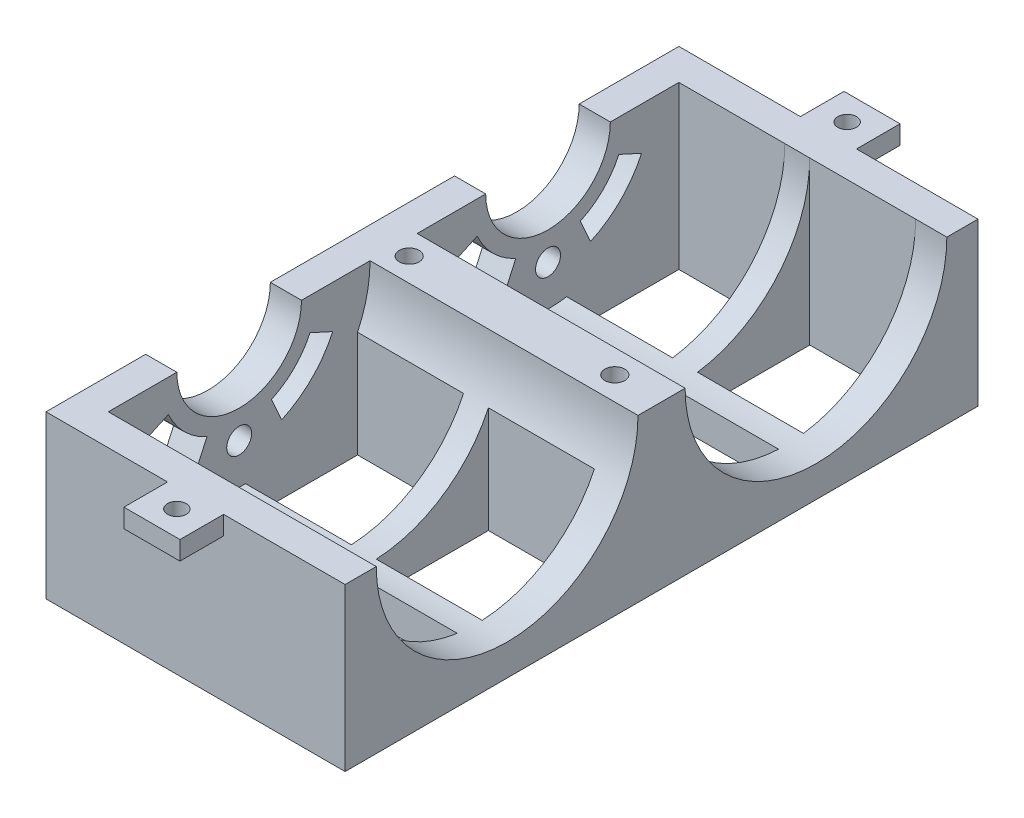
ISO-10303-21;
HEADER;
FILE_DESCRIPTION(('STEP AP214'),'2;1');
FILE_NAME('part.step','',(''),(''),'','','');
FILE_SCHEMA(('AUTOMOTIVE_DESIGN { 1 0 10303 214 1 1 1 1 }'));
ENDSEC;
DATA;
#1=APPLICATION_CONTEXT('core data for automotive mechanical design processes');
#2=APPLICATION_PROTOCOL_DEFINITION('international standard','automotive_design',2000,#1);
#3=PRODUCT_CONTEXT('',#1,'mechanical');
#4=PRODUCT('Part','Part','',(#3));
#5=PRODUCT_RELATED_PRODUCT_CATEGORY('part','',(#4));
#6=PRODUCT_DEFINITION_FORMATION('','',#4);
#7=PRODUCT_DEFINITION_CONTEXT('part definition',#1,'design');
#8=PRODUCT_DEFINITION('design','',#6,#7);
#9=PRODUCT_DEFINITION_SHAPE('','',#8);
#10=(LENGTH_UNIT() NAMED_UNIT(*) SI_UNIT(.MILLI.,.METRE.));
#11=(NAMED_UNIT(*) PLANE_ANGLE_UNIT() SI_UNIT($,.RADIAN.));
#12=(NAMED_UNIT(*) SI_UNIT($,.STERADIAN.) SOLID_ANGLE_UNIT());
#13=UNCERTAINTY_MEASURE_WITH_UNIT(LENGTH_MEASURE(1.E-05),#10,'distance_accuracy_value','');
#14=(GEOMETRIC_REPRESENTATION_CONTEXT(3) GLOBAL_UNCERTAINTY_ASSIGNED_CONTEXT((#13)) GLOBAL_UNIT_ASSIGNED_CONTEXT((#10,
#11,#12)) REPRESENTATION_CONTEXT('',''));
#15=CARTESIAN_POINT('',(0.,0.,0.));
#16=DIRECTION('',(0.,0.,1.));
#17=DIRECTION('',(1.,0.,0.));
#18=AXIS2_PLACEMENT_3D('',#15,#16,#17);
#19=CARTESIAN_POINT('',(0.,0.,0.));
#20=DIRECTION('',(0.,1.,0.));
#21=DIRECTION('',(0.,0.,1.));
#22=AXIS2_PLACEMENT_3D('',#19,#20,#21);
#23=PLANE('',#22);
#24=DIRECTION('',(0.,0.,-1.));
#25=VECTOR('',#24,1.);
#26=CARTESIAN_POINT('',(-5.52234993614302,0.,0.));
#27=LINE('',#26,#25);
#28=CARTESIAN_POINT('',(-5.52234993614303,0.,68.3020178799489));
#29=VERTEX_POINT('',#28);
#30=CARTESIAN_POINT('',(-5.52234993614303,0.,50.3020178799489));
#31=VERTEX_POINT('',#30);
#32=EDGE_CURVE('E60',#29,#31,#27,.T.);
#33=ORIENTED_EDGE('',*,*,#32,.T.);
#34=DIRECTION('',(1.,0.,0.));
#35=VECTOR('',#34,1.);
#36=CARTESIAN_POINT('',(0.,0.,50.3020178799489));
#37=LINE('',#36,#35);
#38=CARTESIAN_POINT('',(-22.522349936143,0.,50.3020178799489));
#39=VERTEX_POINT('',#38);
#40=EDGE_CURVE('E1523',#39,#31,#37,.T.);
#41=ORIENTED_EDGE('',*,*,#40,.F.);
#42=DIRECTION('',(0.,0.,-1.));
#43=VECTOR('',#42,1.);
#44=CARTESIAN_POINT('',(-22.522349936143,0.,0.));
#45=LINE('',#44,#43);
#46=CARTESIAN_POINT('',(-22.522349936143,0.,68.3020178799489));
#47=VERTEX_POINT('',#46);
#48=EDGE_CURVE('E1530',#47,#39,#45,.T.);
#49=ORIENTED_EDGE('',*,*,#48,.F.);
#50=DIRECTION('',(1.,0.,0.));
#51=VECTOR('',#50,1.);
#52=CARTESIAN_POINT('',(0.,0.,68.3020178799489));
#53=LINE('',#52,#51);
#54=EDGE_CURVE('E1533',#47,#29,#53,.T.);
#55=ORIENTED_EDGE('',*,*,#54,.T.);
#56=EDGE_LOOP('',(#33,#41,#49,#55));
#57=FACE_BOUND('',#56,.T.);
#58=DIRECTION('',(0.,0.,-1.));
#59=VECTOR('',#58,1.);
#60=CARTESIAN_POINT('',(-5.52234993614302,0.,0.));
#61=LINE('',#60,#59);
#62=CARTESIAN_POINT('',(-5.52234993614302,0.,16.7420178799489));
#63=VERTEX_POINT('',#62);
#64=CARTESIAN_POINT('',(-5.52234993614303,0.,-1.25798212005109));
#65=VERTEX_POINT('',#64);
#66=EDGE_CURVE('E1592',#63,#65,#61,.T.);
#67=ORIENTED_EDGE('',*,*,#66,.T.);
#68=DIRECTION('',(1.,0.,0.));
#69=VECTOR('',#68,1.);
#70=CARTESIAN_POINT('',(0.,0.,-1.25798212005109));
#71=LINE('',#70,#69);
#72=CARTESIAN_POINT('',(-22.522349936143,0.,-1.25798212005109));
#73=VERTEX_POINT('',#72);
#74=EDGE_CURVE('E1584',#73,#65,#71,.T.);
#75=ORIENTED_EDGE('',*,*,#74,.F.);
#76=DIRECTION('',(0.,0.,-1.));
#77=VECTOR('',#76,1.);
#78=CARTESIAN_POINT('',(-22.522349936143,0.,0.));
#79=LINE('',#78,#77);
#80=CARTESIAN_POINT('',(-22.522349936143,0.,16.7420178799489));
#81=VERTEX_POINT('',#80);
#82=EDGE_CURVE('E465',#81,#73,#79,.T.);
#83=ORIENTED_EDGE('',*,*,#82,.F.);
#84=DIRECTION('',(1.,0.,0.));
#85=VECTOR('',#84,1.);
#86=CARTESIAN_POINT('',(0.,0.,16.7420178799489));
#87=LINE('',#86,#85);
#88=EDGE_CURVE('E1589',#81,#63,#87,.T.);
#89=ORIENTED_EDGE('',*,*,#88,.T.);
#90=EDGE_LOOP('',(#67,#75,#83,#89));
#91=FACE_BOUND('',#90,.T.);
#92=DIRECTION('',(0.,0.,-1.));
#93=VECTOR('',#92,1.);
#94=CARTESIAN_POINT('',(-5.52234993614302,0.,0.));
#95=LINE('',#94,#93);
#96=CARTESIAN_POINT('',(-5.52234993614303,0.,38.7420178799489));
#97=VERTEX_POINT('',#96);
#98=CARTESIAN_POINT('',(-5.52234993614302,0.,20.7420178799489));
#99=VERTEX_POINT('',#98);
#100=EDGE_CURVE('E1547',#97,#99,#95,.T.);
#101=ORIENTED_EDGE('',*,*,#100,.T.);
#102=DIRECTION('',(1.,0.,0.));
#103=VECTOR('',#102,1.);
#104=CARTESIAN_POINT('',(0.,0.,20.7420178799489));
#105=LINE('',#104,#103);
#106=CARTESIAN_POINT('',(-22.522349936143,0.,20.7420178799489));
#107=VERTEX_POINT('',#106);
#108=EDGE_CURVE('E1566',#107,#99,#105,.T.);
#109=ORIENTED_EDGE('',*,*,#108,.F.);
#110=DIRECTION('',(0.,0.,-1.));
#111=VECTOR('',#110,1.);
#112=CARTESIAN_POINT('',(-22.522349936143,0.,0.));
#113=LINE('',#112,#111);
#114=CARTESIAN_POINT('',(-22.522349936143,0.,38.7420178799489));
#115=VERTEX_POINT('',#114);
#116=EDGE_CURVE('E1573',#115,#107,#113,.T.);
#117=ORIENTED_EDGE('',*,*,#116,.F.);
#118=DIRECTION('',(1.,0.,0.));
#119=VECTOR('',#118,1.);
#120=CARTESIAN_POINT('',(0.,0.,38.7420178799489));
#121=LINE('',#120,#119);
#122=EDGE_CURVE('E1576',#115,#97,#121,.T.);
#123=ORIENTED_EDGE('',*,*,#122,.T.);
#124=EDGE_LOOP('',(#101,#109,#117,#123));
#125=FACE_BOUND('',#124,.T.);
#126=DIRECTION('',(-1.,0.,0.));
#127=VECTOR('',#126,1.);
#128=CARTESIAN_POINT('',(33.4436540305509,0.,95.3020178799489));
#129=LINE('',#128,#127);
#130=CARTESIAN_POINT('',(20.477650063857,0.,95.3020178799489));
#131=VERTEX_POINT('',#130);
#132=CARTESIAN_POINT('',(-27.522349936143,0.,95.3020178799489));
#133=VERTEX_POINT('',#132);
#134=EDGE_CURVE('E819',#131,#133,#129,.T.);
#135=ORIENTED_EDGE('',*,*,#134,.T.);
#136=DIRECTION('',(0.,0.,1.));
#137=VECTOR('',#136,1.);
#138=CARTESIAN_POINT('',(-27.522349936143,0.,-6.25798212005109));
#139=LINE('',#138,#137);
#140=CARTESIAN_POINT('',(-27.522349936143,0.,-6.25798212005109));
#141=VERTEX_POINT('',#140);
#142=EDGE_CURVE('E498',#141,#133,#139,.T.);
#143=ORIENTED_EDGE('',*,*,#142,.F.);
#144=DIRECTION('',(-1.,0.,0.));
#145=VECTOR('',#144,1.);
#146=CARTESIAN_POINT('',(-27.522349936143,0.,-6.25798212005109));
#147=LINE('',#146,#145);
#148=CARTESIAN_POINT('',(20.477650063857,0.,-6.25798212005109));
#149=VERTEX_POINT('',#148);
#150=EDGE_CURVE('E515',#149,#141,#147,.T.);
#151=ORIENTED_EDGE('',*,*,#150,.F.);
#152=DIRECTION('',(0.,0.,-1.));
#153=VECTOR('',#152,1.);
#154=CARTESIAN_POINT('',(20.477650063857,0.,-6.25798212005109));
#155=LINE('',#154,#153);
#156=EDGE_CURVE('E513',#131,#149,#155,.T.);
#157=ORIENTED_EDGE('',*,*,#156,.F.);
#158=EDGE_LOOP('',(#135,#143,#151,#157));
#159=FACE_BOUND('',#158,.T.);
#160=CARTESIAN_POINT('',(12.977650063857,0.,44.5220178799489));
#161=DIRECTION('',(0.,1.,0.));
#162=DIRECTION('',(0.,0.,1.));
#163=AXIS2_PLACEMENT_3D('',#160,#161,#162);
#164=CIRCLE('',#163,1.6);
#165=CARTESIAN_POINT('',(12.977650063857,0.,46.1220178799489));
#166=VERTEX_POINT('',#165);
#167=EDGE_CURVE('E701',#166,#166,#164,.F.);
#168=ORIENTED_EDGE('',*,*,#167,.F.);
#169=EDGE_LOOP('',(#168));
#170=FACE_BOUND('',#169,.T.);
#171=CARTESIAN_POINT('',(-20.022349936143,0.,44.5220178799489));
#172=DIRECTION('',(0.,1.,0.));
#173=DIRECTION('',(0.,0.,1.));
#174=AXIS2_PLACEMENT_3D('',#171,#172,#173);
#175=CIRCLE('',#174,1.6);
#176=CARTESIAN_POINT('',(-20.022349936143,0.,46.1220178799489));
#177=VERTEX_POINT('',#176);
#178=EDGE_CURVE('E711',#177,#177,#175,.F.);
#179=ORIENTED_EDGE('',*,*,#178,.F.);
#180=EDGE_LOOP('',(#179));
#181=FACE_BOUND('',#180,.T.);
#182=DIRECTION('',(0.,0.,-1.));
#183=VECTOR('',#182,1.);
#184=CARTESIAN_POINT('',(-5.52234993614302,0.,0.));
#185=LINE('',#184,#183);
#186=CARTESIAN_POINT('',(-5.52234993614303,0.,90.3020178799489));
#187=VERTEX_POINT('',#186);
#188=CARTESIAN_POINT('',(-5.52234993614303,0.,72.3020178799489));
#189=VERTEX_POINT('',#188);
#190=EDGE_CURVE('E656',#187,#189,#185,.T.);
#191=ORIENTED_EDGE('',*,*,#190,.T.);
#192=DIRECTION('',(1.,0.,0.));
#193=VECTOR('',#192,1.);
#194=CARTESIAN_POINT('',(0.,0.,72.3020178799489));
#195=LINE('',#194,#193);
#196=CARTESIAN_POINT('',(-22.522349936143,0.,72.3020178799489));
#197=VERTEX_POINT('',#196);
#198=EDGE_CURVE('E688',#197,#189,#195,.T.);
#199=ORIENTED_EDGE('',*,*,#198,.F.);
#200=DIRECTION('',(0.,0.,-1.));
#201=VECTOR('',#200,1.);
#202=CARTESIAN_POINT('',(-22.522349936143,0.,0.));
#203=LINE('',#202,#201);
#204=CARTESIAN_POINT('',(-22.522349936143,0.,90.3020178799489));
#205=VERTEX_POINT('',#204);
#206=EDGE_CURVE('E694',#205,#197,#203,.T.);
#207=ORIENTED_EDGE('',*,*,#206,.F.);
#208=DIRECTION('',(-1.,0.,0.));
#209=VECTOR('',#208,1.);
#210=CARTESIAN_POINT('',(0.,0.,90.3020178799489));
#211=LINE('',#210,#209);
#212=EDGE_CURVE('E691',#187,#205,#211,.T.);
#213=ORIENTED_EDGE('',*,*,#212,.F.);
#214=EDGE_LOOP('',(#191,#199,#207,#213));
#215=FACE_BOUND('',#214,.T.);
#216=DIRECTION('',(1.,0.,0.));
#217=VECTOR('',#216,1.);
#218=CARTESIAN_POINT('',(0.,0.,16.7420178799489));
#219=LINE('',#218,#217);
#220=CARTESIAN_POINT('',(-1.52234993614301,0.,16.7420178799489));
#221=VERTEX_POINT('',#220);
#222=CARTESIAN_POINT('',(15.477650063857,0.,16.7420178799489));
#223=VERTEX_POINT('',#222);
#224=EDGE_CURVE('E1557',#221,#223,#219,.T.);
#225=ORIENTED_EDGE('',*,*,#224,.T.);
#226=DIRECTION('',(0.,0.,1.));
#227=VECTOR('',#226,1.);
#228=CARTESIAN_POINT('',(15.477650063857,0.,0.));
#229=LINE('',#228,#227);
#230=CARTESIAN_POINT('',(15.477650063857,0.,-1.25798212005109));
#231=VERTEX_POINT('',#230);
#232=EDGE_CURVE('E1548',#231,#223,#229,.T.);
#233=ORIENTED_EDGE('',*,*,#232,.F.);
#234=DIRECTION('',(1.,0.,0.));
#235=VECTOR('',#234,1.);
#236=CARTESIAN_POINT('',(0.,0.,-1.25798212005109));
#237=LINE('',#236,#235);
#238=CARTESIAN_POINT('',(-1.52234993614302,0.,-1.25798212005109));
#239=VERTEX_POINT('',#238);
#240=EDGE_CURVE('E1551',#239,#231,#237,.T.);
#241=ORIENTED_EDGE('',*,*,#240,.F.);
#242=DIRECTION('',(0.,0.,-1.));
#243=VECTOR('',#242,1.);
#244=CARTESIAN_POINT('',(-1.52234993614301,0.,0.));
#245=LINE('',#244,#243);
#246=EDGE_CURVE('E1554',#221,#239,#245,.T.);
#247=ORIENTED_EDGE('',*,*,#246,.F.);
#248=EDGE_LOOP('',(#225,#233,#241,#247));
#249=FACE_BOUND('',#248,.T.);
#250=DIRECTION('',(0.,0.,-1.));
#251=VECTOR('',#250,1.);
#252=CARTESIAN_POINT('',(-1.52234993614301,0.,0.));
#253=LINE('',#252,#251);
#254=CARTESIAN_POINT('',(-1.52234993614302,0.,90.3020178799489));
#255=VERTEX_POINT('',#254);
#256=CARTESIAN_POINT('',(-1.52234993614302,0.,72.3020178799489));
#257=VERTEX_POINT('',#256);
#258=EDGE_CURVE('E645',#255,#257,#253,.T.);
#259=ORIENTED_EDGE('',*,*,#258,.F.);
#260=DIRECTION('',(-1.,0.,0.));
#261=VECTOR('',#260,1.);
#262=CARTESIAN_POINT('',(0.,0.,90.3020178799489));
#263=LINE('',#262,#261);
#264=CARTESIAN_POINT('',(15.477650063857,0.,90.3020178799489));
#265=VERTEX_POINT('',#264);
#266=EDGE_CURVE('E643',#265,#255,#263,.T.);
#267=ORIENTED_EDGE('',*,*,#266,.F.);
#268=DIRECTION('',(0.,0.,1.));
#269=VECTOR('',#268,1.);
#270=CARTESIAN_POINT('',(15.477650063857,0.,0.));
#271=LINE('',#270,#269);
#272=CARTESIAN_POINT('',(15.477650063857,0.,72.3020178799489));
#273=VERTEX_POINT('',#272);
#274=EDGE_CURVE('E642',#273,#265,#271,.T.);
#275=ORIENTED_EDGE('',*,*,#274,.F.);
#276=DIRECTION('',(1.,0.,0.));
#277=VECTOR('',#276,1.);
#278=CARTESIAN_POINT('',(0.,0.,72.3020178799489));
#279=LINE('',#278,#277);
#280=EDGE_CURVE('E649',#257,#273,#279,.T.);
#281=ORIENTED_EDGE('',*,*,#280,.F.);
#282=EDGE_LOOP('',(#259,#267,#275,#281));
#283=FACE_BOUND('',#282,.T.);
#284=DIRECTION('',(1.,0.,0.));
#285=VECTOR('',#284,1.);
#286=CARTESIAN_POINT('',(0.,0.,68.3020178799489));
#287=LINE('',#286,#285);
#288=CARTESIAN_POINT('',(-1.52234993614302,0.,68.3020178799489));
#289=VERTEX_POINT('',#288);
#290=CARTESIAN_POINT('',(15.477650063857,0.,68.3020178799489));
#291=VERTEX_POINT('',#290);
#292=EDGE_CURVE('E663',#289,#291,#287,.T.);
#293=ORIENTED_EDGE('',*,*,#292,.T.);
#294=DIRECTION('',(0.,0.,1.));
#295=VECTOR('',#294,1.);
#296=CARTESIAN_POINT('',(15.477650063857,0.,0.));
#297=LINE('',#296,#295);
#298=CARTESIAN_POINT('',(15.477650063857,0.,50.3020178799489));
#299=VERTEX_POINT('',#298);
#300=EDGE_CURVE('E673',#299,#291,#297,.T.);
#301=ORIENTED_EDGE('',*,*,#300,.F.);
#302=DIRECTION('',(1.,0.,0.));
#303=VECTOR('',#302,1.);
#304=CARTESIAN_POINT('',(0.,0.,50.3020178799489));
#305=LINE('',#304,#303);
#306=CARTESIAN_POINT('',(-1.52234993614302,0.,50.3020178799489));
#307=VERTEX_POINT('',#306);
#308=EDGE_CURVE('E670',#307,#299,#305,.T.);
#309=ORIENTED_EDGE('',*,*,#308,.F.);
#310=DIRECTION('',(0.,0.,-1.));
#311=VECTOR('',#310,1.);
#312=CARTESIAN_POINT('',(-1.52234993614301,0.,0.));
#313=LINE('',#312,#311);
#314=EDGE_CURVE('E666',#289,#307,#313,.T.);
#315=ORIENTED_EDGE('',*,*,#314,.F.);
#316=EDGE_LOOP('',(#293,#301,#309,#315));
#317=FACE_BOUND('',#316,.T.);
#318=DIRECTION('',(1.,0.,0.));
#319=VECTOR('',#318,1.);
#320=CARTESIAN_POINT('',(0.,0.,38.7420178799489));
#321=LINE('',#320,#319);
#322=CARTESIAN_POINT('',(-1.52234993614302,0.,38.7420178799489));
#323=VERTEX_POINT('',#322);
#324=CARTESIAN_POINT('',(15.477650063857,0.,38.7420178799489));
#325=VERTEX_POINT('',#324);
#326=EDGE_CURVE('E52',#323,#325,#321,.T.);
#327=ORIENTED_EDGE('',*,*,#326,.T.);
#328=DIRECTION('',(0.,0.,1.));
#329=VECTOR('',#328,1.);
#330=CARTESIAN_POINT('',(15.477650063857,0.,0.));
#331=LINE('',#330,#329);
#332=CARTESIAN_POINT('',(15.477650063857,0.,20.7420178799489));
#333=VERTEX_POINT('',#332);
#334=EDGE_CURVE('E637',#333,#325,#331,.T.);
#335=ORIENTED_EDGE('',*,*,#334,.F.);
#336=DIRECTION('',(1.,0.,0.));
#337=VECTOR('',#336,1.);
#338=CARTESIAN_POINT('',(0.,0.,20.7420178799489));
#339=LINE('',#338,#337);
#340=CARTESIAN_POINT('',(-1.52234993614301,0.,20.7420178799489));
#341=VERTEX_POINT('',#340);
#342=EDGE_CURVE('E627',#341,#333,#339,.T.);
#343=ORIENTED_EDGE('',*,*,#342,.F.);
#344=DIRECTION('',(0.,0.,-1.));
#345=VECTOR('',#344,1.);
#346=CARTESIAN_POINT('',(-1.52234993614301,0.,0.));
#347=LINE('',#346,#345);
#348=EDGE_CURVE('E1513',#323,#341,#347,.T.);
#349=ORIENTED_EDGE('',*,*,#348,.F.);
#350=EDGE_LOOP('',(#327,#335,#343,#349));
#351=FACE_BOUND('',#350,.T.);
#352=ADVANCED_FACE('F37',(#57,#91,#125,#159,#170,#181,#215,#249,#283,#317,#351),#23,.F.);
#353=CARTESIAN_POINT('',(-22.522349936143,26.,19.7420178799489));
#354=DIRECTION('',(1.,0.,0.));
#355=DIRECTION('',(0.,0.,-1.));
#356=AXIS2_PLACEMENT_3D('',#353,#354,#355);
#357=CYLINDRICAL_SURFACE('',#356,21.);
#358=CARTESIAN_POINT('',(-5.52234993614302,26.,19.7420178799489));
#359=DIRECTION('',(-1.,0.,0.));
#360=DIRECTION('',(0.,0.,1.));
#361=AXIS2_PLACEMENT_3D('',#358,#359,#360);
#362=CIRCLE('',#361,21.);
#363=CARTESIAN_POINT('',(-5.52234993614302,5.21539030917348,16.7420178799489));
#364=VERTEX_POINT('',#363);
#365=CARTESIAN_POINT('',(-5.52234993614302,26.,-1.2579821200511));
#366=VERTEX_POINT('',#365);
#367=EDGE_CURVE('E604',#364,#366,#362,.F.);
#368=ORIENTED_EDGE('',*,*,#367,.F.);
#369=DIRECTION('',(1.,0.,0.));
#370=VECTOR('',#369,1.);
#371=CARTESIAN_POINT('',(-22.522349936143,5.21539030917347,16.7420178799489));
#372=LINE('',#371,#370);
#373=CARTESIAN_POINT('',(-22.522349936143,5.21539030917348,16.7420178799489));
#374=VERTEX_POINT('',#373);
#375=EDGE_CURVE('E602',#374,#364,#372,.T.);
#376=ORIENTED_EDGE('',*,*,#375,.F.);
#377=CARTESIAN_POINT('',(-22.522349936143,26.,19.7420178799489));
#378=DIRECTION('',(1.,0.,0.));
#379=DIRECTION('',(0.,0.,-1.));
#380=AXIS2_PLACEMENT_3D('',#377,#378,#379);
#381=CIRCLE('',#380,21.);
#382=CARTESIAN_POINT('',(-22.522349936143,5.02382303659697,20.7420178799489));
#383=VERTEX_POINT('',#382);
#384=EDGE_CURVE('E496',#383,#374,#381,.T.);
#385=ORIENTED_EDGE('',*,*,#384,.F.);
#386=DIRECTION('',(1.,0.,0.));
#387=VECTOR('',#386,1.);
#388=CARTESIAN_POINT('',(-22.522349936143,5.02382303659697,20.7420178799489));
#389=LINE('',#388,#387);
#390=CARTESIAN_POINT('',(-5.52234993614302,5.02382303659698,20.7420178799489));
#391=VERTEX_POINT('',#390);
#392=EDGE_CURVE('E591',#383,#391,#389,.T.);
#393=ORIENTED_EDGE('',*,*,#392,.T.);
#394=CARTESIAN_POINT('',(-5.52234993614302,26.,19.7420178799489));
#395=DIRECTION('',(-1.,0.,0.));
#396=DIRECTION('',(0.,0.,1.));
#397=AXIS2_PLACEMENT_3D('',#394,#395,#396);
#398=CIRCLE('',#397,21.);
#399=CARTESIAN_POINT('',(-5.52234993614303,17.0557280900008,38.7420178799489));
#400=VERTEX_POINT('',#399);
#401=EDGE_CURVE('E589',#400,#391,#398,.F.);
#402=ORIENTED_EDGE('',*,*,#401,.F.);
#403=DIRECTION('',(1.,0.,0.));
#404=VECTOR('',#403,1.);
#405=CARTESIAN_POINT('',(-22.522349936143,17.0557280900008,38.7420178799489));
#406=LINE('',#405,#404);
#407=CARTESIAN_POINT('',(-22.522349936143,17.0557280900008,38.7420178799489));
#408=VERTEX_POINT('',#407);
#409=EDGE_CURVE('E587',#408,#400,#406,.T.);
#410=ORIENTED_EDGE('',*,*,#409,.F.);
#411=CARTESIAN_POINT('',(-22.522349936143,26.,40.7420178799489));
#412=VERTEX_POINT('',#411);
#413=EDGE_CURVE('E489',#412,#408,#381,.T.);
#414=ORIENTED_EDGE('',*,*,#413,.F.);
#415=DIRECTION('',(1.,0.,0.));
#416=VECTOR('',#415,1.);
#417=CARTESIAN_POINT('',(-22.522349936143,26.,40.7420178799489));
#418=LINE('',#417,#416);
#419=CARTESIAN_POINT('',(20.477650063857,26.,40.7420178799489));
#420=VERTEX_POINT('',#419);
#421=EDGE_CURVE('E478',#412,#420,#418,.T.);
#422=ORIENTED_EDGE('',*,*,#421,.T.);
#423=CARTESIAN_POINT('',(20.477650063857,26.,19.7420178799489));
#424=DIRECTION('',(1.,0.,0.));
#425=DIRECTION('',(0.,0.,-1.));
#426=AXIS2_PLACEMENT_3D('',#423,#424,#425);
#427=CIRCLE('',#426,21.);
#428=CARTESIAN_POINT('',(20.477650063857,26.,-1.2579821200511));
#429=VERTEX_POINT('',#428);
#430=EDGE_CURVE('E493',#420,#429,#427,.T.);
#431=ORIENTED_EDGE('',*,*,#430,.T.);
#432=DIRECTION('',(1.,0.,0.));
#433=VECTOR('',#432,1.);
#434=CARTESIAN_POINT('',(-22.522349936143,26.,-1.2579821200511));
#435=LINE('',#434,#433);
#436=CARTESIAN_POINT('',(15.477650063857,26.,-1.2579821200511));
#437=VERTEX_POINT('',#436);
#438=EDGE_CURVE('E481',#437,#429,#435,.T.);
#439=ORIENTED_EDGE('',*,*,#438,.F.);
#440=CARTESIAN_POINT('',(15.477650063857,26.,19.7420178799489));
#441=DIRECTION('',(1.,0.,0.));
#442=DIRECTION('',(0.,0.,-1.));
#443=AXIS2_PLACEMENT_3D('',#440,#441,#442);
#444=CIRCLE('',#443,21.);
#445=CARTESIAN_POINT('',(15.477650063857,5.21539030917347,16.7420178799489));
#446=VERTEX_POINT('',#445);
#447=EDGE_CURVE('E599',#437,#446,#444,.F.);
#448=ORIENTED_EDGE('',*,*,#447,.T.);
#449=DIRECTION('',(1.,0.,0.));
#450=VECTOR('',#449,1.);
#451=CARTESIAN_POINT('',(-22.522349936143,5.21539030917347,16.7420178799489));
#452=LINE('',#451,#450);
#453=CARTESIAN_POINT('',(-1.52234993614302,5.21539030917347,16.7420178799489));
#454=VERTEX_POINT('',#453);
#455=EDGE_CURVE('E597',#454,#446,#452,.T.);
#456=ORIENTED_EDGE('',*,*,#455,.F.);
#457=CARTESIAN_POINT('',(-1.52234993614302,26.,19.7420178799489));
#458=DIRECTION('',(-1.,0.,0.));
#459=DIRECTION('',(0.,0.,1.));
#460=AXIS2_PLACEMENT_3D('',#457,#458,#459);
#461=CIRCLE('',#460,21.);
#462=CARTESIAN_POINT('',(-1.52234993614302,26.,-1.25798212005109));
#463=VERTEX_POINT('',#462);
#464=EDGE_CURVE('E594',#454,#463,#461,.F.);
#465=ORIENTED_EDGE('',*,*,#464,.T.);
#466=EDGE_CURVE('E479',#366,#463,#435,.T.);
#467=ORIENTED_EDGE('',*,*,#466,.F.);
#468=EDGE_LOOP('',(#368,#376,#385,#393,#402,#410,#414,#422,#431,#439,#448,#456,#465,#467));
#469=FACE_BOUND('',#468,.T.);
#470=DIRECTION('',(1.,0.,0.));
#471=VECTOR('',#470,1.);
#472=CARTESIAN_POINT('',(-22.522349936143,17.0557280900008,38.7420178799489));
#473=LINE('',#472,#471);
#474=CARTESIAN_POINT('',(-1.52234993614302,17.0557280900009,38.7420178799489));
#475=VERTEX_POINT('',#474);
#476=CARTESIAN_POINT('',(15.477650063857,17.0557280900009,38.7420178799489));
#477=VERTEX_POINT('',#476);
#478=EDGE_CURVE('E11',#475,#477,#473,.T.);
#479=ORIENTED_EDGE('',*,*,#478,.F.);
#480=CARTESIAN_POINT('',(-1.52234993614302,26.,19.7420178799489));
#481=DIRECTION('',(-1.,0.,0.));
#482=DIRECTION('',(0.,0.,1.));
#483=AXIS2_PLACEMENT_3D('',#480,#481,#482);
#484=CIRCLE('',#483,21.);
#485=CARTESIAN_POINT('',(-1.52234993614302,5.02382303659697,20.7420178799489));
#486=VERTEX_POINT('',#485);
#487=EDGE_CURVE('E606',#475,#486,#484,.F.);
#488=ORIENTED_EDGE('',*,*,#487,.T.);
#489=DIRECTION('',(1.,0.,0.));
#490=VECTOR('',#489,1.);
#491=CARTESIAN_POINT('',(-22.522349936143,5.02382303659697,20.7420178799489));
#492=LINE('',#491,#490);
#493=CARTESIAN_POINT('',(15.477650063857,5.02382303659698,20.7420178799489));
#494=VERTEX_POINT('',#493);
#495=EDGE_CURVE('E609',#486,#494,#492,.T.);
#496=ORIENTED_EDGE('',*,*,#495,.T.);
#497=CARTESIAN_POINT('',(15.477650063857,26.,19.7420178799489));
#498=DIRECTION('',(1.,0.,0.));
#499=DIRECTION('',(0.,0.,-1.));
#500=AXIS2_PLACEMENT_3D('',#497,#498,#499);
#501=CIRCLE('',#500,21.);
#502=EDGE_CURVE('E45',#494,#477,#501,.F.);
#503=ORIENTED_EDGE('',*,*,#502,.T.);
#504=EDGE_LOOP('',(#479,#488,#496,#503));
#505=FACE_BOUND('',#504,.T.);
#506=ADVANCED_FACE('F614',(#469,#505),#357,.F.);
#507=CARTESIAN_POINT('',(76.4436540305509,25.9999999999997,69.3020178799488));
#508=DIRECTION('',(-1.,0.,0.));
#509=DIRECTION('',(0.,0.,1.));
#510=AXIS2_PLACEMENT_3D('',#507,#508,#509);
#511=CYLINDRICAL_SURFACE('',#510,20.9999999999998);
#512=CARTESIAN_POINT('',(-22.522349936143,25.9999999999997,69.3020178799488));
#513=DIRECTION('',(1.,0.,0.));
#514=DIRECTION('',(0.,0.,-1.));
#515=AXIS2_PLACEMENT_3D('',#512,#513,#514);
#516=CIRCLE('',#515,20.9999999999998);
#517=CARTESIAN_POINT('',(-22.522349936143,17.0557280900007,50.3020178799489));
#518=VERTEX_POINT('',#517);
#519=CARTESIAN_POINT('',(-22.522349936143,26.,48.3020178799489));
#520=VERTEX_POINT('',#519);
#521=EDGE_CURVE('E551',#518,#520,#516,.T.);
#522=ORIENTED_EDGE('',*,*,#521,.F.);
#523=DIRECTION('',(-1.,0.,0.));
#524=VECTOR('',#523,1.);
#525=CARTESIAN_POINT('',(76.4436540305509,17.0557280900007,50.3020178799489));
#526=LINE('',#525,#524);
#527=CARTESIAN_POINT('',(-5.52234993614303,17.0557280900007,50.3020178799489));
#528=VERTEX_POINT('',#527);
#529=EDGE_CURVE('E584',#518,#528,#526,.F.);
#530=ORIENTED_EDGE('',*,*,#529,.T.);
#531=CARTESIAN_POINT('',(-5.52234993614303,25.9999999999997,69.3020178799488));
#532=DIRECTION('',(-1.,0.,0.));
#533=DIRECTION('',(0.,0.,1.));
#534=AXIS2_PLACEMENT_3D('',#531,#532,#533);
#535=CIRCLE('',#534,20.9999999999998);
#536=CARTESIAN_POINT('',(-5.52234993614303,5.02382303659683,68.3020178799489));
#537=VERTEX_POINT('',#536);
#538=EDGE_CURVE('E582',#537,#528,#535,.F.);
#539=ORIENTED_EDGE('',*,*,#538,.F.);
#540=DIRECTION('',(-1.,0.,0.));
#541=VECTOR('',#540,1.);
#542=CARTESIAN_POINT('',(76.4436540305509,5.02382303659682,68.3020178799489));
#543=LINE('',#542,#541);
#544=CARTESIAN_POINT('',(-22.522349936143,5.02382303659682,68.3020178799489));
#545=VERTEX_POINT('',#544);
#546=EDGE_CURVE('E580',#545,#537,#543,.F.);
#547=ORIENTED_EDGE('',*,*,#546,.F.);
#548=CARTESIAN_POINT('',(-22.522349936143,5.21539030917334,72.3020178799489));
#549=VERTEX_POINT('',#548);
#550=EDGE_CURVE('E554',#549,#545,#516,.T.);
#551=ORIENTED_EDGE('',*,*,#550,.F.);
#552=DIRECTION('',(-1.,0.,0.));
#553=VECTOR('',#552,1.);
#554=CARTESIAN_POINT('',(76.4436540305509,5.21539030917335,72.3020178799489));
#555=LINE('',#554,#553);
#556=CARTESIAN_POINT('',(-5.52234993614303,5.21539030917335,72.3020178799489));
#557=VERTEX_POINT('',#556);
#558=EDGE_CURVE('E555',#549,#557,#555,.F.);
#559=ORIENTED_EDGE('',*,*,#558,.T.);
#560=CARTESIAN_POINT('',(-5.52234993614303,25.9999999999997,69.3020178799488));
#561=DIRECTION('',(-1.,0.,0.));
#562=DIRECTION('',(0.,0.,1.));
#563=AXIS2_PLACEMENT_3D('',#560,#561,#562);
#564=CIRCLE('',#563,20.9999999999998);
#565=CARTESIAN_POINT('',(-5.52234993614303,26.,90.3020178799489));
#566=VERTEX_POINT('',#565);
#567=EDGE_CURVE('E558',#566,#557,#564,.F.);
#568=ORIENTED_EDGE('',*,*,#567,.F.);
#569=DIRECTION('',(-1.,0.,0.));
#570=VECTOR('',#569,1.);
#571=CARTESIAN_POINT('',(76.4436540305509,26.,90.3020178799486));
#572=LINE('',#571,#570);
#573=CARTESIAN_POINT('',(-1.52234993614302,26.,90.3020178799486));
#574=VERTEX_POINT('',#573);
#575=EDGE_CURVE('E767',#574,#566,#572,.T.);
#576=ORIENTED_EDGE('',*,*,#575,.F.);
#577=CARTESIAN_POINT('',(-1.52234993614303,25.9999999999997,69.3020178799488));
#578=DIRECTION('',(-1.,0.,0.));
#579=DIRECTION('',(0.,0.,1.));
#580=AXIS2_PLACEMENT_3D('',#577,#578,#579);
#581=CIRCLE('',#580,20.9999999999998);
#582=CARTESIAN_POINT('',(-1.52234993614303,5.21539030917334,72.3020178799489));
#583=VERTEX_POINT('',#582);
#584=EDGE_CURVE('E560',#574,#583,#581,.F.);
#585=ORIENTED_EDGE('',*,*,#584,.T.);
#586=DIRECTION('',(-1.,0.,0.));
#587=VECTOR('',#586,1.);
#588=CARTESIAN_POINT('',(76.4436540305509,5.21539030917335,72.3020178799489));
#589=LINE('',#588,#587);
#590=CARTESIAN_POINT('',(15.477650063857,5.21539030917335,72.3020178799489));
#591=VERTEX_POINT('',#590);
#592=EDGE_CURVE('E563',#583,#591,#589,.F.);
#593=ORIENTED_EDGE('',*,*,#592,.T.);
#594=CARTESIAN_POINT('',(15.477650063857,25.9999999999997,69.3020178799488));
#595=DIRECTION('',(1.,0.,0.));
#596=DIRECTION('',(0.,0.,-1.));
#597=AXIS2_PLACEMENT_3D('',#594,#595,#596);
#598=CIRCLE('',#597,20.9999999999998);
#599=CARTESIAN_POINT('',(15.477650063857,26.,90.3020178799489));
#600=VERTEX_POINT('',#599);
#601=EDGE_CURVE('E566',#591,#600,#598,.F.);
#602=ORIENTED_EDGE('',*,*,#601,.T.);
#603=CARTESIAN_POINT('',(20.477650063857,26.,90.3020178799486));
#604=VERTEX_POINT('',#603);
#605=EDGE_CURVE('E758',#604,#600,#572,.T.);
#606=ORIENTED_EDGE('',*,*,#605,.F.);
#607=CARTESIAN_POINT('',(20.477650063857,25.9999999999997,69.3020178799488));
#608=DIRECTION('',(-1.,0.,0.));
#609=DIRECTION('',(0.,0.,1.));
#610=AXIS2_PLACEMENT_3D('',#607,#608,#609);
#611=CIRCLE('',#610,20.9999999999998);
#612=CARTESIAN_POINT('',(20.477650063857,26.,48.3020178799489));
#613=VERTEX_POINT('',#612);
#614=EDGE_CURVE('E761',#604,#613,#611,.F.);
#615=ORIENTED_EDGE('',*,*,#614,.T.);
#616=DIRECTION('',(-1.,0.,0.));
#617=VECTOR('',#616,1.);
#618=CARTESIAN_POINT('',(76.4436540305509,26.,48.3020178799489));
#619=LINE('',#618,#617);
#620=EDGE_CURVE('E747',#613,#520,#619,.T.);
#621=ORIENTED_EDGE('',*,*,#620,.T.);
#622=EDGE_LOOP('',(#522,#530,#539,#547,#551,#559,#568,#576,#585,#593,#602,#606,#615,#621));
#623=FACE_BOUND('',#622,.T.);
#624=DIRECTION('',(-1.,0.,0.));
#625=VECTOR('',#624,1.);
#626=CARTESIAN_POINT('',(76.4436540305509,5.02382303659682,68.3020178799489));
#627=LINE('',#626,#625);
#628=CARTESIAN_POINT('',(-1.52234993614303,5.02382303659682,68.3020178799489));
#629=VERTEX_POINT('',#628);
#630=CARTESIAN_POINT('',(15.477650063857,5.02382303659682,68.3020178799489));
#631=VERTEX_POINT('',#630);
#632=EDGE_CURVE('E578',#629,#631,#627,.F.);
#633=ORIENTED_EDGE('',*,*,#632,.F.);
#634=CARTESIAN_POINT('',(-1.52234993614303,25.9999999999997,69.3020178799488));
#635=DIRECTION('',(-1.,0.,0.));
#636=DIRECTION('',(0.,0.,1.));
#637=AXIS2_PLACEMENT_3D('',#634,#635,#636);
#638=CIRCLE('',#637,20.9999999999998);
#639=CARTESIAN_POINT('',(-1.52234993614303,17.0557280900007,50.3020178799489));
#640=VERTEX_POINT('',#639);
#641=EDGE_CURVE('E569',#629,#640,#638,.F.);
#642=ORIENTED_EDGE('',*,*,#641,.T.);
#643=DIRECTION('',(-1.,0.,0.));
#644=VECTOR('',#643,1.);
#645=CARTESIAN_POINT('',(76.4436540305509,17.0557280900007,50.3020178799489));
#646=LINE('',#645,#644);
#647=CARTESIAN_POINT('',(15.477650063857,17.0557280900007,50.3020178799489));
#648=VERTEX_POINT('',#647);
#649=EDGE_CURVE('E572',#640,#648,#646,.F.);
#650=ORIENTED_EDGE('',*,*,#649,.T.);
#651=CARTESIAN_POINT('',(15.477650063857,25.9999999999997,69.3020178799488));
#652=DIRECTION('',(1.,0.,0.));
#653=DIRECTION('',(0.,0.,-1.));
#654=AXIS2_PLACEMENT_3D('',#651,#652,#653);
#655=CIRCLE('',#654,20.9999999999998);
#656=EDGE_CURVE('E575',#648,#631,#655,.F.);
#657=ORIENTED_EDGE('',*,*,#656,.T.);
#658=EDGE_LOOP('',(#633,#642,#650,#657));
#659=FACE_BOUND('',#658,.T.);
#660=ADVANCED_FACE('F994',(#623,#659),#511,.F.);
#661=CARTESIAN_POINT('',(-22.522349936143,0.,0.));
#662=DIRECTION('',(1.,0.,0.));
#663=DIRECTION('',(0.,0.,-1.));
#664=AXIS2_PLACEMENT_3D('',#661,#662,#663);
#665=PLANE('',#664);
#666=ORIENTED_EDGE('',*,*,#521,.T.);
#667=DIRECTION('',(0.,0.,-1.));
#668=VECTOR('',#667,1.);
#669=CARTESIAN_POINT('',(-22.522349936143,26.,0.));
#670=LINE('',#669,#668);
#671=CARTESIAN_POINT('',(-22.522349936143,26.,59.3020178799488));
#672=VERTEX_POINT('',#671);
#673=EDGE_CURVE('E816',#672,#520,#670,.T.);
#674=ORIENTED_EDGE('',*,*,#673,.F.);
#675=CARTESIAN_POINT('',(-22.522349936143,25.9999999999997,69.3020178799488));
#676=DIRECTION('',(1.,0.,0.));
#677=DIRECTION('',(0.,0.,-1.));
#678=AXIS2_PLACEMENT_3D('',#675,#676,#677);
#679=CIRCLE('',#678,9.99999999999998);
#680=CARTESIAN_POINT('',(-22.522349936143,26.,79.3020178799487));
#681=VERTEX_POINT('',#680);
#682=EDGE_CURVE('E778',#672,#681,#679,.F.);
#683=ORIENTED_EDGE('',*,*,#682,.T.);
#684=DIRECTION('',(0.,0.,-1.));
#685=VECTOR('',#684,1.);
#686=CARTESIAN_POINT('',(-22.522349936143,26.,0.));
#687=LINE('',#686,#685);
#688=CARTESIAN_POINT('',(-22.522349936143,26.,90.3020178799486));
#689=VERTEX_POINT('',#688);
#690=EDGE_CURVE('E764',#689,#681,#687,.T.);
#691=ORIENTED_EDGE('',*,*,#690,.F.);
#692=DIRECTION('',(0.,-1.,0.));
#693=VECTOR('',#692,1.);
#694=CARTESIAN_POINT('',(-22.522349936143,26.,90.3020178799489));
#695=LINE('',#694,#693);
#696=EDGE_CURVE('E704',#689,#205,#695,.T.);
#697=ORIENTED_EDGE('',*,*,#696,.T.);
#698=ORIENTED_EDGE('',*,*,#206,.T.);
#699=DIRECTION('',(0.,-1.,0.));
#700=VECTOR('',#699,1.);
#701=CARTESIAN_POINT('',(-22.522349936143,26.,72.3020178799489));
#702=LINE('',#701,#700);
#703=EDGE_CURVE('E702',#549,#197,#702,.T.);
#704=ORIENTED_EDGE('',*,*,#703,.F.);
#705=ORIENTED_EDGE('',*,*,#550,.T.);
#706=DIRECTION('',(0.,-1.,0.));
#707=VECTOR('',#706,1.);
#708=CARTESIAN_POINT('',(-22.522349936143,26.,68.3020178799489));
#709=LINE('',#708,#707);
#710=EDGE_CURVE('E1522',#545,#47,#709,.T.);
#711=ORIENTED_EDGE('',*,*,#710,.T.);
#712=ORIENTED_EDGE('',*,*,#48,.T.);
#713=DIRECTION('',(0.,-1.,0.));
#714=VECTOR('',#713,1.);
#715=CARTESIAN_POINT('',(-22.522349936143,26.,50.3020178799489));
#716=LINE('',#715,#714);
#717=EDGE_CURVE('E1525',#518,#39,#716,.T.);
#718=ORIENTED_EDGE('',*,*,#717,.F.);
#719=EDGE_LOOP('',(#666,#674,#683,#691,#697,#698,#704,#705,#711,#712,#718));
#720=FACE_BOUND('',#719,.T.);
#721=CARTESIAN_POINT('',(-22.522349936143,11.5,69.3020178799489));
#722=DIRECTION('',(1.,0.,0.));
#723=DIRECTION('',(0.,0.,-1.));
#724=AXIS2_PLACEMENT_3D('',#721,#722,#723);
#725=CIRCLE('',#724,2.);
#726=CARTESIAN_POINT('',(-22.522349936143,11.5,71.3020178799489));
#727=VERTEX_POINT('',#726);
#728=EDGE_CURVE('E811',#727,#727,#725,.F.);
#729=ORIENTED_EDGE('',*,*,#728,.T.);
#730=EDGE_LOOP('',(#729));
#731=FACE_BOUND('',#730,.T.);
#732=CARTESIAN_POINT('',(-22.522349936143,25.9999999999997,69.3020178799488));
#733=DIRECTION('',(1.,0.,0.));
#734=DIRECTION('',(0.,0.,-1.));
#735=AXIS2_PLACEMENT_3D('',#732,#733,#734);
#736=CIRCLE('',#735,12.5);
#737=CARTESIAN_POINT('',(-22.522349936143,14.6203631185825,74.4744316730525));
#738=VERTEX_POINT('',#737);
#739=CARTESIAN_POINT('',(-22.522349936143,20.8050877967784,80.6714016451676));
#740=VERTEX_POINT('',#739);
#741=EDGE_CURVE('E837',#738,#740,#736,.F.);
#742=ORIENTED_EDGE('',*,*,#741,.F.);
#743=DIRECTION('',(0.,-0.910370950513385,0.413793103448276));
#744=VECTOR('',#743,1.);
#745=CARTESIAN_POINT('',(-22.522349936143,30.558274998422,67.230134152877));
#746=LINE('',#745,#744);
#747=CARTESIAN_POINT('',(-22.522349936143,10.9788793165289,76.1296040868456));
#748=VERTEX_POINT('',#747);
#749=EDGE_CURVE('E836',#738,#748,#746,.T.);
#750=ORIENTED_EDGE('',*,*,#749,.T.);
#751=CARTESIAN_POINT('',(-22.522349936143,25.9999999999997,69.3020178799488));
#752=DIRECTION('',(1.,0.,0.));
#753=DIRECTION('',(0.,0.,-1.));
#754=AXIS2_PLACEMENT_3D('',#751,#752,#753);
#755=CIRCLE('',#754,16.5);
#756=CARTESIAN_POINT('',(-22.522349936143,19.1427158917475,84.3096044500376));
#757=VERTEX_POINT('',#756);
#758=EDGE_CURVE('E815',#748,#757,#755,.F.);
#759=ORIENTED_EDGE('',*,*,#758,.T.);
#760=DIRECTION('',(0.,-0.415592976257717,0.909550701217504));
#761=VECTOR('',#760,1.);
#762=CARTESIAN_POINT('',(-22.522349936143,47.7057069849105,21.7977477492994));
#763=LINE('',#762,#761);
#764=EDGE_CURVE('E826',#740,#757,#763,.T.);
#765=ORIENTED_EDGE('',*,*,#764,.F.);
#766=EDGE_LOOP('',(#742,#750,#759,#765));
#767=FACE_BOUND('',#766,.T.);
#768=CARTESIAN_POINT('',(-22.522349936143,25.9999999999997,69.3020178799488));
#769=DIRECTION('',(1.,0.,0.));
#770=DIRECTION('',(0.,0.,-1.));
#771=AXIS2_PLACEMENT_3D('',#768,#769,#770);
#772=CIRCLE('',#771,12.5);
#773=CARTESIAN_POINT('',(-22.522349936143,20.8050877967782,57.93263411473));
#774=VERTEX_POINT('',#773);
#775=CARTESIAN_POINT('',(-22.522349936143,14.6203631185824,64.1296040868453));
#776=VERTEX_POINT('',#775);
#777=EDGE_CURVE('E818',#774,#776,#772,.F.);
#778=ORIENTED_EDGE('',*,*,#777,.F.);
#779=DIRECTION('',(0.,-0.415592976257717,-0.909550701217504));
#780=VECTOR('',#779,1.);
#781=CARTESIAN_POINT('',(-22.522349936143,-4.68701812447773,2.14159783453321));
#782=LINE('',#781,#780);
#783=CARTESIAN_POINT('',(-22.522349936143,19.1427158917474,54.2944313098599));
#784=VERTEX_POINT('',#783);
#785=EDGE_CURVE('E832',#774,#784,#782,.T.);
#786=ORIENTED_EDGE('',*,*,#785,.T.);
#787=CARTESIAN_POINT('',(-22.522349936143,25.9999999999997,69.3020178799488));
#788=DIRECTION('',(1.,0.,0.));
#789=DIRECTION('',(0.,0.,-1.));
#790=AXIS2_PLACEMENT_3D('',#787,#788,#789);
#791=CIRCLE('',#790,16.5);
#792=CARTESIAN_POINT('',(-22.522349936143,10.9788793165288,62.4744316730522));
#793=VERTEX_POINT('',#792);
#794=EDGE_CURVE('E834',#784,#793,#791,.F.);
#795=ORIENTED_EDGE('',*,*,#794,.T.);
#796=DIRECTION('',(0.,-0.910370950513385,-0.413793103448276));
#797=VECTOR('',#796,1.);
#798=CARTESIAN_POINT('',(-22.522349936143,-21.6545889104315,47.6414626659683));
#799=LINE('',#798,#797);
#800=EDGE_CURVE('E783',#776,#793,#799,.T.);
#801=ORIENTED_EDGE('',*,*,#800,.F.);
#802=EDGE_LOOP('',(#778,#786,#795,#801));
#803=FACE_BOUND('',#802,.T.);
#804=ADVANCED_FACE('F1036',(#720,#731,#767,#803),#665,.T.);
#805=CARTESIAN_POINT('',(-27.522349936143,26.,-6.25798212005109));
#806=DIRECTION('',(0.,0.,1.));
#807=DIRECTION('',(1.,0.,0.));
#808=AXIS2_PLACEMENT_3D('',#805,#806,#807);
#809=PLANE('',#808);
#810=DIRECTION('',(0.,1.,0.));
#811=VECTOR('',#810,1.);
#812=CARTESIAN_POINT('',(-8.02234993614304,23.,-6.25798212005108));
#813=LINE('',#812,#811);
#814=CARTESIAN_POINT('',(-8.02234993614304,23.,-6.25798212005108));
#815=VERTEX_POINT('',#814);
#816=CARTESIAN_POINT('',(-8.02234993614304,26.,-6.25798212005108));
#817=VERTEX_POINT('',#816);
#818=EDGE_CURVE('E888',#815,#817,#813,.T.);
#819=ORIENTED_EDGE('',*,*,#818,.F.);
#820=DIRECTION('',(1.,0.,0.));
#821=VECTOR('',#820,1.);
#822=CARTESIAN_POINT('',(0.,23.,-6.25798212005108));
#823=LINE('',#822,#821);
#824=CARTESIAN_POINT('',(0.977650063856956,23.,-6.25798212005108));
#825=VERTEX_POINT('',#824);
#826=EDGE_CURVE('E872',#815,#825,#823,.T.);
#827=ORIENTED_EDGE('',*,*,#826,.T.);
#828=DIRECTION('',(0.,1.,0.));
#829=VECTOR('',#828,1.);
#830=CARTESIAN_POINT('',(0.977650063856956,23.,-6.25798212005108));
#831=LINE('',#830,#829);
#832=CARTESIAN_POINT('',(0.977650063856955,26.,-6.25798212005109));
#833=VERTEX_POINT('',#832);
#834=EDGE_CURVE('E884',#825,#833,#831,.T.);
#835=ORIENTED_EDGE('',*,*,#834,.T.);
#836=DIRECTION('',(-1.,0.,0.));
#837=VECTOR('',#836,1.);
#838=CARTESIAN_POINT('',(-27.522349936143,26.,-6.25798212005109));
#839=LINE('',#838,#837);
#840=CARTESIAN_POINT('',(20.477650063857,26.,-6.25798212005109));
#841=VERTEX_POINT('',#840);
#842=EDGE_CURVE('E508',#841,#833,#839,.T.);
#843=ORIENTED_EDGE('',*,*,#842,.F.);
#844=DIRECTION('',(0.,-1.,0.));
#845=VECTOR('',#844,1.);
#846=CARTESIAN_POINT('',(20.477650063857,26.,-6.25798212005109));
#847=LINE('',#846,#845);
#848=EDGE_CURVE('E519',#841,#149,#847,.T.);
#849=ORIENTED_EDGE('',*,*,#848,.T.);
#850=ORIENTED_EDGE('',*,*,#150,.T.);
#851=DIRECTION('',(0.,-1.,0.));
#852=VECTOR('',#851,1.);
#853=CARTESIAN_POINT('',(-27.522349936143,26.,-6.25798212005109));
#854=LINE('',#853,#852);
#855=CARTESIAN_POINT('',(-27.522349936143,26.,-6.25798212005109));
#856=VERTEX_POINT('',#855);
#857=EDGE_CURVE('E511',#856,#141,#854,.T.);
#858=ORIENTED_EDGE('',*,*,#857,.F.);
#859=EDGE_CURVE('E507',#817,#856,#839,.T.);
#860=ORIENTED_EDGE('',*,*,#859,.F.);
#861=EDGE_LOOP('',(#819,#827,#835,#843,#849,#850,#858,#860));
#862=FACE_BOUND('',#861,.T.);
#863=ADVANCED_FACE('F953',(#862),#809,.F.);
#864=CARTESIAN_POINT('',(-27.522349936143,26.,-6.25798212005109));
#865=DIRECTION('',(1.,0.,0.));
#866=DIRECTION('',(0.,0.,-1.));
#867=AXIS2_PLACEMENT_3D('',#864,#865,#866);
#868=PLANE('',#867);
#869=DIRECTION('',(0.,0.,-1.));
#870=VECTOR('',#869,1.);
#871=CARTESIAN_POINT('',(-27.522349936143,26.,0.));
#872=LINE('',#871,#870);
#873=CARTESIAN_POINT('',(-27.522349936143,26.,95.3020178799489));
#874=VERTEX_POINT('',#873);
#875=CARTESIAN_POINT('',(-27.522349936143,26.,79.3020178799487));
#876=VERTEX_POINT('',#875);
#877=EDGE_CURVE('E779',#874,#876,#872,.T.);
#878=ORIENTED_EDGE('',*,*,#877,.T.);
#879=CARTESIAN_POINT('',(-27.522349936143,25.9999999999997,69.3020178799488));
#880=DIRECTION('',(-1.,0.,0.));
#881=DIRECTION('',(0.,0.,1.));
#882=AXIS2_PLACEMENT_3D('',#879,#880,#881);
#883=CIRCLE('',#882,9.99999999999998);
#884=CARTESIAN_POINT('',(-27.522349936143,26.,59.3020178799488));
#885=VERTEX_POINT('',#884);
#886=EDGE_CURVE('E780',#885,#876,#883,.T.);
#887=ORIENTED_EDGE('',*,*,#886,.F.);
#888=DIRECTION('',(0.,0.,1.));
#889=VECTOR('',#888,1.);
#890=CARTESIAN_POINT('',(-27.522349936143,26.,-6.25798212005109));
#891=LINE('',#890,#889);
#892=CARTESIAN_POINT('',(-27.522349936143,26.,29.7420178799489));
#893=VERTEX_POINT('',#892);
#894=EDGE_CURVE('E503',#893,#885,#891,.T.);
#895=ORIENTED_EDGE('',*,*,#894,.F.);
#896=CARTESIAN_POINT('',(-27.522349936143,26.,19.7420178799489));
#897=DIRECTION('',(-1.,0.,0.));
#898=DIRECTION('',(0.,0.,1.));
#899=AXIS2_PLACEMENT_3D('',#896,#897,#898);
#900=CIRCLE('',#899,10.);
#901=CARTESIAN_POINT('',(-27.522349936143,26.,9.74201787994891));
#902=VERTEX_POINT('',#901);
#903=EDGE_CURVE('E528',#902,#893,#900,.T.);
#904=ORIENTED_EDGE('',*,*,#903,.F.);
#905=EDGE_CURVE('E500',#856,#902,#891,.T.);
#906=ORIENTED_EDGE('',*,*,#905,.F.);
#907=ORIENTED_EDGE('',*,*,#857,.T.);
#908=ORIENTED_EDGE('',*,*,#142,.T.);
#909=DIRECTION('',(0.,1.,0.));
#910=VECTOR('',#909,1.);
#911=CARTESIAN_POINT('',(-27.522349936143,0.,95.3020178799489));
#912=LINE('',#911,#910);
#913=EDGE_CURVE('E775',#133,#874,#912,.T.);
#914=ORIENTED_EDGE('',*,*,#913,.T.);
#915=EDGE_LOOP('',(#878,#887,#895,#904,#906,#907,#908,#914));
#916=FACE_BOUND('',#915,.T.);
#917=CARTESIAN_POINT('',(-27.522349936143,26.,19.7420178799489));
#918=DIRECTION('',(-1.,0.,0.));
#919=DIRECTION('',(0.,0.,1.));
#920=AXIS2_PLACEMENT_3D('',#917,#918,#919);
#921=CIRCLE('',#920,12.5);
#922=CARTESIAN_POINT('',(-27.522349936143,14.6203631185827,24.9144316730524));
#923=VERTEX_POINT('',#922);
#924=CARTESIAN_POINT('',(-27.522349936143,20.8050877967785,31.1114016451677));
#925=VERTEX_POINT('',#924);
#926=EDGE_CURVE('E887',#923,#925,#921,.T.);
#927=ORIENTED_EDGE('',*,*,#926,.T.);
#928=DIRECTION('',(0.,-0.415592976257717,0.909550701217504));
#929=VECTOR('',#928,1.);
#930=CARTESIAN_POINT('',(-27.522349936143,28.9718841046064,13.2378673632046));
#931=LINE('',#930,#929);
#932=CARTESIAN_POINT('',(-27.522349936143,19.1427158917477,34.7496044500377));
#933=VERTEX_POINT('',#932);
#934=EDGE_CURVE('E924',#925,#933,#931,.T.);
#935=ORIENTED_EDGE('',*,*,#934,.T.);
#936=CARTESIAN_POINT('',(-27.522349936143,26.,19.7420178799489));
#937=DIRECTION('',(-1.,0.,0.));
#938=DIRECTION('',(0.,0.,1.));
#939=AXIS2_PLACEMENT_3D('',#936,#937,#938);
#940=CIRCLE('',#939,16.5);
#941=CARTESIAN_POINT('',(-27.522349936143,10.9788793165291,26.5696040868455));
#942=VERTEX_POINT('',#941);
#943=EDGE_CURVE('E921',#942,#933,#940,.T.);
#944=ORIENTED_EDGE('',*,*,#943,.F.);
#945=DIRECTION('',(0.,-0.910370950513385,0.413793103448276));
#946=VECTOR('',#945,1.);
#947=CARTESIAN_POINT('',(-27.522349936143,11.8887642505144,26.1560318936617));
#948=LINE('',#947,#946);
#949=EDGE_CURVE('E918',#923,#942,#948,.T.);
#950=ORIENTED_EDGE('',*,*,#949,.F.);
#951=EDGE_LOOP('',(#927,#935,#944,#950));
#952=FACE_BOUND('',#951,.T.);
#953=CARTESIAN_POINT('',(-27.522349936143,11.5,19.7420178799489));
#954=DIRECTION('',(-1.,0.,0.));
#955=DIRECTION('',(0.,0.,1.));
#956=AXIS2_PLACEMENT_3D('',#953,#954,#955);
#957=CIRCLE('',#956,2.);
#958=CARTESIAN_POINT('',(-27.522349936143,11.5,21.7420178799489));
#959=VERTEX_POINT('',#958);
#960=EDGE_CURVE('E529',#959,#959,#957,.T.);
#961=ORIENTED_EDGE('',*,*,#960,.F.);
#962=EDGE_LOOP('',(#961));
#963=FACE_BOUND('',#962,.T.);
#964=CARTESIAN_POINT('',(-27.522349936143,26.,19.7420178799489));
#965=DIRECTION('',(-1.,0.,0.));
#966=DIRECTION('',(0.,0.,1.));
#967=AXIS2_PLACEMENT_3D('',#964,#965,#966);
#968=CIRCLE('',#967,12.5);
#969=CARTESIAN_POINT('',(-27.522349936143,20.8050877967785,8.37263411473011));
#970=VERTEX_POINT('',#969);
#971=CARTESIAN_POINT('',(-27.522349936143,14.6203631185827,14.5696040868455));
#972=VERTEX_POINT('',#971);
#973=EDGE_CURVE('E894',#970,#972,#968,.T.);
#974=ORIENTED_EDGE('',*,*,#973,.T.);
#975=DIRECTION('',(0.,-0.910370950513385,-0.413793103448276));
#976=VECTOR('',#975,1.);
#977=CARTESIAN_POINT('',(-27.522349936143,-2.98507816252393,6.56736040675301));
#978=LINE('',#977,#976);
#979=CARTESIAN_POINT('',(-27.522349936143,10.9788793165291,12.9144316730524));
#980=VERTEX_POINT('',#979);
#981=EDGE_CURVE('E904',#972,#980,#978,.T.);
#982=ORIENTED_EDGE('',*,*,#981,.T.);
#983=CARTESIAN_POINT('',(-27.522349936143,26.,19.7420178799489));
#984=DIRECTION('',(-1.,0.,0.));
#985=DIRECTION('',(0.,0.,1.));
#986=AXIS2_PLACEMENT_3D('',#983,#984,#985);
#987=CIRCLE('',#986,16.5);
#988=CARTESIAN_POINT('',(-27.522349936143,19.1427158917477,4.7344313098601));
#989=VERTEX_POINT('',#988);
#990=EDGE_CURVE('E901',#989,#980,#987,.T.);
#991=ORIENTED_EDGE('',*,*,#990,.F.);
#992=DIRECTION('',(0.,-0.415592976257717,-0.909550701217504));
#993=VECTOR('',#992,1.);
#994=CARTESIAN_POINT('',(-27.522349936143,14.0468047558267,-6.41828255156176));
#995=LINE('',#994,#993);
#996=EDGE_CURVE('E897',#970,#989,#995,.T.);
#997=ORIENTED_EDGE('',*,*,#996,.F.);
#998=EDGE_LOOP('',(#974,#982,#991,#997));
#999=FACE_BOUND('',#998,.T.);
#1000=CARTESIAN_POINT('',(-27.522349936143,11.5,69.3020178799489));
#1001=DIRECTION('',(-1.,0.,0.));
#1002=DIRECTION('',(0.,0.,1.));
#1003=AXIS2_PLACEMENT_3D('',#1000,#1001,#1002);
#1004=CIRCLE('',#1003,2.);
#1005=CARTESIAN_POINT('',(-27.522349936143,11.5,71.3020178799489));
#1006=VERTEX_POINT('',#1005);
#1007=EDGE_CURVE('E770',#1006,#1006,#1004,.T.);
#1008=ORIENTED_EDGE('',*,*,#1007,.F.);
#1009=EDGE_LOOP('',(#1008));
#1010=FACE_BOUND('',#1009,.T.);
#1011=CARTESIAN_POINT('',(-27.522349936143,25.9999999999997,69.3020178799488));
#1012=DIRECTION('',(-1.,0.,0.));
#1013=DIRECTION('',(0.,0.,1.));
#1014=AXIS2_PLACEMENT_3D('',#1011,#1012,#1013);
#1015=CIRCLE('',#1014,12.5);
#1016=CARTESIAN_POINT('',(-27.522349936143,20.8050877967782,57.9326341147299));
#1017=VERTEX_POINT('',#1016);
#1018=CARTESIAN_POINT('',(-27.522349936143,14.6203631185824,64.1296040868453));
#1019=VERTEX_POINT('',#1018);
#1020=EDGE_CURVE('E794',#1017,#1019,#1015,.T.);
#1021=ORIENTED_EDGE('',*,*,#1020,.T.);
#1022=DIRECTION('',(0.,-0.910370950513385,-0.413793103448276));
#1023=VECTOR('',#1022,1.);
#1024=CARTESIAN_POINT('',(-27.522349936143,-21.6545889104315,47.6414626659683));
#1025=LINE('',#1024,#1023);
#1026=CARTESIAN_POINT('',(-27.522349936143,10.9788793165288,62.4744316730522));
#1027=VERTEX_POINT('',#1026);
#1028=EDGE_CURVE('E786',#1019,#1027,#1025,.T.);
#1029=ORIENTED_EDGE('',*,*,#1028,.T.);
#1030=CARTESIAN_POINT('',(-27.522349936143,25.9999999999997,69.3020178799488));
#1031=DIRECTION('',(-1.,0.,0.));
#1032=DIRECTION('',(0.,0.,1.));
#1033=AXIS2_PLACEMENT_3D('',#1030,#1031,#1032);
#1034=CIRCLE('',#1033,16.5);
#1035=CARTESIAN_POINT('',(-27.522349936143,19.1427158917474,54.2944313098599));
#1036=VERTEX_POINT('',#1035);
#1037=EDGE_CURVE('E806',#1036,#1027,#1034,.T.);
#1038=ORIENTED_EDGE('',*,*,#1037,.F.);
#1039=DIRECTION('',(0.,-0.415592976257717,-0.909550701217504));
#1040=VECTOR('',#1039,1.);
#1041=CARTESIAN_POINT('',(-27.522349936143,-4.68701812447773,2.14159783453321));
#1042=LINE('',#1041,#1040);
#1043=EDGE_CURVE('E787',#1017,#1036,#1042,.T.);
#1044=ORIENTED_EDGE('',*,*,#1043,.F.);
#1045=EDGE_LOOP('',(#1021,#1029,#1038,#1044));
#1046=FACE_BOUND('',#1045,.T.);
#1047=CARTESIAN_POINT('',(-27.522349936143,25.9999999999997,69.3020178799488));
#1048=DIRECTION('',(-1.,0.,0.));
#1049=DIRECTION('',(0.,0.,1.));
#1050=AXIS2_PLACEMENT_3D('',#1047,#1048,#1049);
#1051=CIRCLE('',#1050,12.5);
#1052=CARTESIAN_POINT('',(-27.522349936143,14.6203631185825,74.4744316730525));
#1053=VERTEX_POINT('',#1052);
#1054=CARTESIAN_POINT('',(-27.522349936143,20.8050877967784,80.6714016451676));
#1055=VERTEX_POINT('',#1054);
#1056=EDGE_CURVE('E773',#1053,#1055,#1051,.T.);
#1057=ORIENTED_EDGE('',*,*,#1056,.T.);
#1058=DIRECTION('',(0.,-0.415592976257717,0.909550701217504));
#1059=VECTOR('',#1058,1.);
#1060=CARTESIAN_POINT('',(-27.522349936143,47.7057069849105,21.7977477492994));
#1061=LINE('',#1060,#1059);
#1062=CARTESIAN_POINT('',(-27.522349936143,19.1427158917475,84.3096044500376));
#1063=VERTEX_POINT('',#1062);
#1064=EDGE_CURVE('E797',#1055,#1063,#1061,.T.);
#1065=ORIENTED_EDGE('',*,*,#1064,.T.);
#1066=CARTESIAN_POINT('',(-27.522349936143,10.9788793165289,76.1296040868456));
#1067=VERTEX_POINT('',#1066);
#1068=EDGE_CURVE('E803',#1067,#1063,#1034,.T.);
#1069=ORIENTED_EDGE('',*,*,#1068,.F.);
#1070=DIRECTION('',(0.,-0.910370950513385,0.413793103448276));
#1071=VECTOR('',#1070,1.);
#1072=CARTESIAN_POINT('',(-27.522349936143,30.558274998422,67.230134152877));
#1073=LINE('',#1072,#1071);
#1074=EDGE_CURVE('E798',#1053,#1067,#1073,.T.);
#1075=ORIENTED_EDGE('',*,*,#1074,.F.);
#1076=EDGE_LOOP('',(#1057,#1065,#1069,#1075));
#1077=FACE_BOUND('',#1076,.T.);
#1078=ADVANCED_FACE('F39',(#916,#952,#963,#999,#1010,#1046,#1077),#868,.F.);
#1079=CARTESIAN_POINT('',(-22.522349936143,0.,0.));
#1080=DIRECTION('',(1.,0.,0.));
#1081=DIRECTION('',(0.,0.,-1.));
#1082=AXIS2_PLACEMENT_3D('',#1079,#1080,#1081);
#1083=PLANE('',#1082);
#1084=DIRECTION('',(0.,0.,1.));
#1085=VECTOR('',#1084,1.);
#1086=CARTESIAN_POINT('',(-22.522349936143,26.,0.));
#1087=LINE('',#1086,#1085);
#1088=CARTESIAN_POINT('',(-22.522349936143,26.,-1.25798212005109));
#1089=VERTEX_POINT('',#1088);
#1090=CARTESIAN_POINT('',(-22.522349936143,26.,9.74201787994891));
#1091=VERTEX_POINT('',#1090);
#1092=EDGE_CURVE('E463',#1089,#1091,#1087,.T.);
#1093=ORIENTED_EDGE('',*,*,#1092,.T.);
#1094=CARTESIAN_POINT('',(-22.522349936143,26.,19.7420178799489));
#1095=DIRECTION('',(1.,0.,0.));
#1096=DIRECTION('',(0.,0.,-1.));
#1097=AXIS2_PLACEMENT_3D('',#1094,#1095,#1096);
#1098=CIRCLE('',#1097,10.);
#1099=CARTESIAN_POINT('',(-22.522349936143,26.,29.7420178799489));
#1100=VERTEX_POINT('',#1099);
#1101=EDGE_CURVE('E522',#1100,#1091,#1098,.T.);
#1102=ORIENTED_EDGE('',*,*,#1101,.F.);
#1103=EDGE_CURVE('E487',#1100,#412,#1087,.T.);
#1104=ORIENTED_EDGE('',*,*,#1103,.T.);
#1105=ORIENTED_EDGE('',*,*,#413,.T.);
#1106=DIRECTION('',(0.,-1.,0.));
#1107=VECTOR('',#1106,1.);
#1108=CARTESIAN_POINT('',(-22.522349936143,26.,38.7420178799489));
#1109=LINE('',#1108,#1107);
#1110=EDGE_CURVE('E1565',#408,#115,#1109,.T.);
#1111=ORIENTED_EDGE('',*,*,#1110,.T.);
#1112=ORIENTED_EDGE('',*,*,#116,.T.);
#1113=DIRECTION('',(0.,-1.,0.));
#1114=VECTOR('',#1113,1.);
#1115=CARTESIAN_POINT('',(-22.522349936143,26.,20.7420178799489));
#1116=LINE('',#1115,#1114);
#1117=EDGE_CURVE('E1568',#383,#107,#1116,.T.);
#1118=ORIENTED_EDGE('',*,*,#1117,.F.);
#1119=ORIENTED_EDGE('',*,*,#384,.T.);
#1120=DIRECTION('',(0.,-1.,0.));
#1121=VECTOR('',#1120,1.);
#1122=CARTESIAN_POINT('',(-22.522349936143,26.,16.7420178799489));
#1123=LINE('',#1122,#1121);
#1124=EDGE_CURVE('E470',#374,#81,#1123,.T.);
#1125=ORIENTED_EDGE('',*,*,#1124,.T.);
#1126=ORIENTED_EDGE('',*,*,#82,.T.);
#1127=DIRECTION('',(0.,-1.,0.));
#1128=VECTOR('',#1127,1.);
#1129=CARTESIAN_POINT('',(-22.522349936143,26.,-1.25798212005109));
#1130=LINE('',#1129,#1128);
#1131=EDGE_CURVE('E457',#1089,#73,#1130,.T.);
#1132=ORIENTED_EDGE('',*,*,#1131,.F.);
#1133=EDGE_LOOP('',(#1093,#1102,#1104,#1105,#1111,#1112,#1118,#1119,#1125,#1126,#1132));
#1134=FACE_BOUND('',#1133,.T.);
#1135=DIRECTION('',(0.,0.910370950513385,0.413793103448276));
#1136=VECTOR('',#1135,1.);
#1137=CARTESIAN_POINT('',(-22.522349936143,-2.98507816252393,6.56736040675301));
#1138=LINE('',#1137,#1136);
#1139=CARTESIAN_POINT('',(-22.522349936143,10.9788793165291,12.9144316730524));
#1140=VERTEX_POINT('',#1139);
#1141=CARTESIAN_POINT('',(-22.522349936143,14.6203631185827,14.5696040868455));
#1142=VERTEX_POINT('',#1141);
#1143=EDGE_CURVE('E534',#1140,#1142,#1138,.T.);
#1144=ORIENTED_EDGE('',*,*,#1143,.T.);
#1145=CARTESIAN_POINT('',(-22.522349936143,26.,19.7420178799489));
#1146=DIRECTION('',(1.,0.,0.));
#1147=DIRECTION('',(0.,0.,-1.));
#1148=AXIS2_PLACEMENT_3D('',#1145,#1146,#1147);
#1149=CIRCLE('',#1148,12.5);
#1150=CARTESIAN_POINT('',(-22.522349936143,20.8050877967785,8.37263411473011));
#1151=VERTEX_POINT('',#1150);
#1152=EDGE_CURVE('E537',#1142,#1151,#1149,.T.);
#1153=ORIENTED_EDGE('',*,*,#1152,.T.);
#1154=DIRECTION('',(0.,0.415592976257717,0.909550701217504));
#1155=VECTOR('',#1154,1.);
#1156=CARTESIAN_POINT('',(-22.522349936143,14.0468047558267,-6.41828255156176));
#1157=LINE('',#1156,#1155);
#1158=CARTESIAN_POINT('',(-22.522349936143,19.1427158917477,4.7344313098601));
#1159=VERTEX_POINT('',#1158);
#1160=EDGE_CURVE('E524',#1159,#1151,#1157,.T.);
#1161=ORIENTED_EDGE('',*,*,#1160,.F.);
#1162=CARTESIAN_POINT('',(-22.522349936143,26.,19.7420178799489));
#1163=DIRECTION('',(1.,0.,0.));
#1164=DIRECTION('',(0.,0.,-1.));
#1165=AXIS2_PLACEMENT_3D('',#1162,#1163,#1164);
#1166=CIRCLE('',#1165,16.5);
#1167=EDGE_CURVE('E531',#1140,#1159,#1166,.T.);
#1168=ORIENTED_EDGE('',*,*,#1167,.F.);
#1169=EDGE_LOOP('',(#1144,#1153,#1161,#1168));
#1170=FACE_BOUND('',#1169,.T.);
#1171=CARTESIAN_POINT('',(-22.522349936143,11.5,19.7420178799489));
#1172=DIRECTION('',(1.,0.,0.));
#1173=DIRECTION('',(0.,0.,-1.));
#1174=AXIS2_PLACEMENT_3D('',#1171,#1172,#1173);
#1175=CIRCLE('',#1174,2.);
#1176=CARTESIAN_POINT('',(-22.522349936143,11.5,17.7420178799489));
#1177=VERTEX_POINT('',#1176);
#1178=EDGE_CURVE('E525',#1177,#1177,#1175,.T.);
#1179=ORIENTED_EDGE('',*,*,#1178,.F.);
#1180=EDGE_LOOP('',(#1179));
#1181=FACE_BOUND('',#1180,.T.);
#1182=DIRECTION('',(0.,0.415592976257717,-0.909550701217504));
#1183=VECTOR('',#1182,1.);
#1184=CARTESIAN_POINT('',(-22.522349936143,28.9718841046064,13.2378673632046));
#1185=LINE('',#1184,#1183);
#1186=CARTESIAN_POINT('',(-22.522349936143,19.1427158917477,34.7496044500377));
#1187=VERTEX_POINT('',#1186);
#1188=CARTESIAN_POINT('',(-22.522349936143,20.8050877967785,31.1114016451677));
#1189=VERTEX_POINT('',#1188);
#1190=EDGE_CURVE('E545',#1187,#1189,#1185,.T.);
#1191=ORIENTED_EDGE('',*,*,#1190,.T.);
#1192=CARTESIAN_POINT('',(-22.522349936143,26.,19.7420178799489));
#1193=DIRECTION('',(1.,0.,0.));
#1194=DIRECTION('',(0.,0.,-1.));
#1195=AXIS2_PLACEMENT_3D('',#1192,#1193,#1194);
#1196=CIRCLE('',#1195,12.5);
#1197=CARTESIAN_POINT('',(-22.522349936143,14.6203631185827,24.9144316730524));
#1198=VERTEX_POINT('',#1197);
#1199=EDGE_CURVE('E548',#1189,#1198,#1196,.T.);
#1200=ORIENTED_EDGE('',*,*,#1199,.T.);
#1201=DIRECTION('',(0.,0.910370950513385,-0.413793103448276));
#1202=VECTOR('',#1201,1.);
#1203=CARTESIAN_POINT('',(-22.522349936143,11.8887642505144,26.1560318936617));
#1204=LINE('',#1203,#1202);
#1205=CARTESIAN_POINT('',(-22.522349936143,10.9788793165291,26.5696040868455));
#1206=VERTEX_POINT('',#1205);
#1207=EDGE_CURVE('E540',#1206,#1198,#1204,.T.);
#1208=ORIENTED_EDGE('',*,*,#1207,.F.);
#1209=CARTESIAN_POINT('',(-22.522349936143,26.,19.7420178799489));
#1210=DIRECTION('',(1.,0.,0.));
#1211=DIRECTION('',(0.,0.,-1.));
#1212=AXIS2_PLACEMENT_3D('',#1209,#1210,#1211);
#1213=CIRCLE('',#1212,16.5);
#1214=EDGE_CURVE('E542',#1187,#1206,#1213,.T.);
#1215=ORIENTED_EDGE('',*,*,#1214,.F.);
#1216=EDGE_LOOP('',(#1191,#1200,#1208,#1215));
#1217=FACE_BOUND('',#1216,.T.);
#1218=ADVANCED_FACE('F459',(#1134,#1170,#1181,#1217),#1083,.T.);
#1219=CARTESIAN_POINT('',(0.,26.,0.));
#1220=DIRECTION('',(0.,1.,0.));
#1221=DIRECTION('',(0.,0.,1.));
#1222=AXIS2_PLACEMENT_3D('',#1219,#1220,#1221);
#1223=PLANE('',#1222);
#1224=DIRECTION('',(-1.,0.,0.));
#1225=VECTOR('',#1224,1.);
#1226=CARTESIAN_POINT('',(20.477650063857,26.,9.7420178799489));
#1227=LINE('',#1226,#1225);
#1228=EDGE_CURVE('E486',#1091,#902,#1227,.T.);
#1229=ORIENTED_EDGE('',*,*,#1228,.F.);
#1230=ORIENTED_EDGE('',*,*,#1092,.F.);
#1231=EDGE_CURVE('E473',#1089,#366,#435,.T.);
#1232=ORIENTED_EDGE('',*,*,#1231,.T.);
#1233=ORIENTED_EDGE('',*,*,#466,.T.);
#1234=DIRECTION('',(1.,0.,0.));
#1235=VECTOR('',#1234,1.);
#1236=CARTESIAN_POINT('',(0.,26.,-1.25798212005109));
#1237=LINE('',#1236,#1235);
#1238=EDGE_CURVE('E1541',#463,#437,#1237,.T.);
#1239=ORIENTED_EDGE('',*,*,#1238,.T.);
#1240=ORIENTED_EDGE('',*,*,#438,.T.);
#1241=DIRECTION('',(0.,0.,-1.));
#1242=VECTOR('',#1241,1.);
#1243=CARTESIAN_POINT('',(20.477650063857,26.,-6.25798212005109));
#1244=LINE('',#1243,#1242);
#1245=EDGE_CURVE('E502',#429,#841,#1244,.T.);
#1246=ORIENTED_EDGE('',*,*,#1245,.T.);
#1247=ORIENTED_EDGE('',*,*,#842,.T.);
#1248=DIRECTION('',(0.,0.,1.));
#1249=VECTOR('',#1248,1.);
#1250=CARTESIAN_POINT('',(0.977650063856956,26.,0.));
#1251=LINE('',#1250,#1249);
#1252=CARTESIAN_POINT('',(0.977650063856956,26.,-13.2579821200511));
#1253=VERTEX_POINT('',#1252);
#1254=EDGE_CURVE('E878',#1253,#833,#1251,.T.);
#1255=ORIENTED_EDGE('',*,*,#1254,.F.);
#1256=DIRECTION('',(1.,0.,0.));
#1257=VECTOR('',#1256,1.);
#1258=CARTESIAN_POINT('',(0.,26.,-13.2579821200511));
#1259=LINE('',#1258,#1257);
#1260=CARTESIAN_POINT('',(-8.02234993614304,26.,-13.2579821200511));
#1261=VERTEX_POINT('',#1260);
#1262=EDGE_CURVE('E880',#1261,#1253,#1259,.T.);
#1263=ORIENTED_EDGE('',*,*,#1262,.F.);
#1264=DIRECTION('',(0.,0.,1.));
#1265=VECTOR('',#1264,1.);
#1266=CARTESIAN_POINT('',(-8.02234993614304,26.,0.));
#1267=LINE('',#1266,#1265);
#1268=EDGE_CURVE('E866',#1261,#817,#1267,.T.);
#1269=ORIENTED_EDGE('',*,*,#1268,.T.);
#1270=ORIENTED_EDGE('',*,*,#859,.T.);
#1271=ORIENTED_EDGE('',*,*,#905,.T.);
#1272=EDGE_LOOP('',(#1229,#1230,#1232,#1233,#1239,#1240,#1246,#1247,#1255,#1263,#1269,#1270,#1271));
#1273=FACE_BOUND('',#1272,.T.);
#1274=CARTESIAN_POINT('',(-3.52234993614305,26.,-9.25798212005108));
#1275=DIRECTION('',(0.,1.,0.));
#1276=DIRECTION('',(0.,0.,1.));
#1277=AXIS2_PLACEMENT_3D('',#1274,#1275,#1276);
#1278=CIRCLE('',#1277,1.5);
#1279=CARTESIAN_POINT('',(-3.52234993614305,26.,-7.75798212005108));
#1280=VERTEX_POINT('',#1279);
#1281=EDGE_CURVE('E814',#1280,#1280,#1278,.T.);
#1282=ORIENTED_EDGE('',*,*,#1281,.F.);
#1283=EDGE_LOOP('',(#1282));
#1284=FACE_BOUND('',#1283,.T.);
#1285=ADVANCED_FACE('F483',(#1273,#1284),#1223,.T.);
#1286=CARTESIAN_POINT('',(20.477650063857,26.,-6.25798212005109));
#1287=DIRECTION('',(-1.,0.,0.));
#1288=DIRECTION('',(0.,0.,1.));
#1289=AXIS2_PLACEMENT_3D('',#1286,#1287,#1288);
#1290=PLANE('',#1289);
#1291=ORIENTED_EDGE('',*,*,#1245,.F.);
#1292=ORIENTED_EDGE('',*,*,#430,.F.);
#1293=EDGE_CURVE('E504',#613,#420,#1244,.T.);
#1294=ORIENTED_EDGE('',*,*,#1293,.F.);
#1295=ORIENTED_EDGE('',*,*,#614,.F.);
#1296=DIRECTION('',(0.,0.,1.));
#1297=VECTOR('',#1296,1.);
#1298=CARTESIAN_POINT('',(20.477650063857,26.,0.));
#1299=LINE('',#1298,#1297);
#1300=CARTESIAN_POINT('',(20.477650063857,26.,95.3020178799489));
#1301=VERTEX_POINT('',#1300);
#1302=EDGE_CURVE('E757',#604,#1301,#1299,.T.);
#1303=ORIENTED_EDGE('',*,*,#1302,.T.);
#1304=DIRECTION('',(0.,-1.,0.));
#1305=VECTOR('',#1304,1.);
#1306=CARTESIAN_POINT('',(20.477650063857,0.,95.3020178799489));
#1307=LINE('',#1306,#1305);
#1308=EDGE_CURVE('E754',#1301,#131,#1307,.T.);
#1309=ORIENTED_EDGE('',*,*,#1308,.T.);
#1310=ORIENTED_EDGE('',*,*,#156,.T.);
#1311=ORIENTED_EDGE('',*,*,#848,.F.);
#1312=EDGE_LOOP('',(#1291,#1292,#1294,#1295,#1303,#1309,#1310,#1311));
#1313=FACE_BOUND('',#1312,.T.);
#1314=ADVANCED_FACE('F989',(#1313),#1290,.F.);
#1315=CARTESIAN_POINT('',(-20.022349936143,26.,44.5220178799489));
#1316=DIRECTION('',(0.,1.,0.));
#1317=DIRECTION('',(0.,0.,1.));
#1318=AXIS2_PLACEMENT_3D('',#1315,#1316,#1317);
#1319=CIRCLE('',#1318,1.6);
#1320=CARTESIAN_POINT('',(-20.022349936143,26.,46.1220178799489));
#1321=VERTEX_POINT('',#1320);
#1322=EDGE_CURVE('E708',#1321,#1321,#1319,.T.);
#1323=ORIENTED_EDGE('',*,*,#1322,.F.);
#1324=EDGE_LOOP('',(#1323));
#1325=FACE_BOUND('',#1324,.T.);
#1326=CARTESIAN_POINT('',(12.977650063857,26.,44.5220178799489));
#1327=DIRECTION('',(0.,1.,0.));
#1328=DIRECTION('',(0.,0.,1.));
#1329=AXIS2_PLACEMENT_3D('',#1326,#1327,#1328);
#1330=CIRCLE('',#1329,1.6);
#1331=CARTESIAN_POINT('',(12.977650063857,26.,46.1220178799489));
#1332=VERTEX_POINT('',#1331);
#1333=EDGE_CURVE('E712',#1332,#1332,#1330,.T.);
#1334=ORIENTED_EDGE('',*,*,#1333,.F.);
#1335=EDGE_LOOP('',(#1334));
#1336=FACE_BOUND('',#1335,.T.);
#1337=ORIENTED_EDGE('',*,*,#894,.T.);
#1338=DIRECTION('',(-1.,0.,0.));
#1339=VECTOR('',#1338,1.);
#1340=CARTESIAN_POINT('',(33.4436540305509,26.,59.3020178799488));
#1341=LINE('',#1340,#1339);
#1342=EDGE_CURVE('E784',#672,#885,#1341,.T.);
#1343=ORIENTED_EDGE('',*,*,#1342,.F.);
#1344=ORIENTED_EDGE('',*,*,#673,.T.);
#1345=ORIENTED_EDGE('',*,*,#620,.F.);
#1346=ORIENTED_EDGE('',*,*,#1293,.T.);
#1347=ORIENTED_EDGE('',*,*,#421,.F.);
#1348=ORIENTED_EDGE('',*,*,#1103,.F.);
#1349=DIRECTION('',(-1.,0.,0.));
#1350=VECTOR('',#1349,1.);
#1351=CARTESIAN_POINT('',(20.477650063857,26.,29.7420178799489));
#1352=LINE('',#1351,#1350);
#1353=EDGE_CURVE('E497',#1100,#893,#1352,.T.);
#1354=ORIENTED_EDGE('',*,*,#1353,.T.);
#1355=EDGE_LOOP('',(#1337,#1343,#1344,#1345,#1346,#1347,#1348,#1354));
#1356=FACE_BOUND('',#1355,.T.);
#1357=ADVANCED_FACE('F976',(#1325,#1336,#1356),#1223,.T.);
#1358=CARTESIAN_POINT('',(20.477650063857,26.,19.7420178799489));
#1359=DIRECTION('',(-1.,0.,0.));
#1360=DIRECTION('',(0.,0.,1.));
#1361=AXIS2_PLACEMENT_3D('',#1358,#1359,#1360);
#1362=CYLINDRICAL_SURFACE('',#1361,10.);
#1363=ORIENTED_EDGE('',*,*,#1101,.T.);
#1364=ORIENTED_EDGE('',*,*,#1228,.T.);
#1365=ORIENTED_EDGE('',*,*,#903,.T.);
#1366=ORIENTED_EDGE('',*,*,#1353,.F.);
#1367=EDGE_LOOP('',(#1363,#1364,#1365,#1366));
#1368=FACE_BOUND('',#1367,.T.);
#1369=ADVANCED_FACE('F941',(#1368),#1362,.F.);
#1370=CARTESIAN_POINT('',(20.477650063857,11.5,19.7420178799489));
#1371=DIRECTION('',(-1.,0.,0.));
#1372=DIRECTION('',(0.,0.,1.));
#1373=AXIS2_PLACEMENT_3D('',#1370,#1371,#1372);
#1374=CYLINDRICAL_SURFACE('',#1373,2.);
#1375=ORIENTED_EDGE('',*,*,#1178,.T.);
#1376=EDGE_LOOP('',(#1375));
#1377=FACE_BOUND('',#1376,.T.);
#1378=ORIENTED_EDGE('',*,*,#960,.T.);
#1379=EDGE_LOOP('',(#1378));
#1380=FACE_BOUND('',#1379,.T.);
#1381=ADVANCED_FACE('F1056',(#1377,#1380),#1374,.F.);
#1382=CARTESIAN_POINT('',(20.477650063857,26.,19.7420178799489));
#1383=DIRECTION('',(-1.,0.,0.));
#1384=DIRECTION('',(0.,0.,1.));
#1385=AXIS2_PLACEMENT_3D('',#1382,#1383,#1384);
#1386=CYLINDRICAL_SURFACE('',#1385,12.5);
#1387=DIRECTION('',(-1.,0.,0.));
#1388=VECTOR('',#1387,1.);
#1389=CARTESIAN_POINT('',(20.477650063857,14.6203631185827,14.5696040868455));
#1390=LINE('',#1389,#1388);
#1391=EDGE_CURVE('E908',#1142,#972,#1390,.T.);
#1392=ORIENTED_EDGE('',*,*,#1391,.T.);
#1393=ORIENTED_EDGE('',*,*,#973,.F.);
#1394=DIRECTION('',(-1.,0.,0.));
#1395=VECTOR('',#1394,1.);
#1396=CARTESIAN_POINT('',(20.477650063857,20.8050877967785,8.37263411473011));
#1397=LINE('',#1396,#1395);
#1398=EDGE_CURVE('E907',#1151,#970,#1397,.T.);
#1399=ORIENTED_EDGE('',*,*,#1398,.F.);
#1400=ORIENTED_EDGE('',*,*,#1152,.F.);
#1401=EDGE_LOOP('',(#1392,#1393,#1399,#1400));
#1402=FACE_BOUND('',#1401,.T.);
#1403=ADVANCED_FACE('F1059',(#1402),#1386,.T.);
#1404=CARTESIAN_POINT('',(20.477650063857,-2.98507816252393,6.56736040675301));
#1405=DIRECTION('',(0.,0.413793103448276,-0.910370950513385));
#1406=DIRECTION('',(0.,0.910370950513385,0.413793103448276));
#1407=AXIS2_PLACEMENT_3D('',#1404,#1405,#1406);
#1408=PLANE('',#1407);
#1409=DIRECTION('',(-1.,0.,0.));
#1410=VECTOR('',#1409,1.);
#1411=CARTESIAN_POINT('',(20.477650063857,10.9788793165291,12.9144316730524));
#1412=LINE('',#1411,#1410);
#1413=EDGE_CURVE('E910',#1140,#980,#1412,.T.);
#1414=ORIENTED_EDGE('',*,*,#1413,.T.);
#1415=ORIENTED_EDGE('',*,*,#981,.F.);
#1416=ORIENTED_EDGE('',*,*,#1391,.F.);
#1417=ORIENTED_EDGE('',*,*,#1143,.F.);
#1418=EDGE_LOOP('',(#1414,#1415,#1416,#1417));
#1419=FACE_BOUND('',#1418,.T.);
#1420=ADVANCED_FACE('F1081',(#1419),#1408,.T.);
#1421=CARTESIAN_POINT('',(20.477650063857,26.,19.7420178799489));
#1422=DIRECTION('',(-1.,0.,0.));
#1423=DIRECTION('',(0.,0.,1.));
#1424=AXIS2_PLACEMENT_3D('',#1421,#1422,#1423);
#1425=CYLINDRICAL_SURFACE('',#1424,16.5);
#1426=ORIENTED_EDGE('',*,*,#1167,.T.);
#1427=DIRECTION('',(-1.,0.,0.));
#1428=VECTOR('',#1427,1.);
#1429=CARTESIAN_POINT('',(20.477650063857,19.1427158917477,4.7344313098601));
#1430=LINE('',#1429,#1428);
#1431=EDGE_CURVE('E912',#1159,#989,#1430,.T.);
#1432=ORIENTED_EDGE('',*,*,#1431,.T.);
#1433=ORIENTED_EDGE('',*,*,#990,.T.);
#1434=ORIENTED_EDGE('',*,*,#1413,.F.);
#1435=EDGE_LOOP('',(#1426,#1432,#1433,#1434));
#1436=FACE_BOUND('',#1435,.T.);
#1437=ADVANCED_FACE('F1085',(#1436),#1425,.F.);
#1438=CARTESIAN_POINT('',(20.477650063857,14.0468047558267,-6.41828255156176));
#1439=DIRECTION('',(0.,0.909550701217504,-0.415592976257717));
#1440=DIRECTION('',(0.,0.415592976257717,0.909550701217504));
#1441=AXIS2_PLACEMENT_3D('',#1438,#1439,#1440);
#1442=PLANE('',#1441);
#1443=ORIENTED_EDGE('',*,*,#1160,.T.);
#1444=ORIENTED_EDGE('',*,*,#1398,.T.);
#1445=ORIENTED_EDGE('',*,*,#996,.T.);
#1446=ORIENTED_EDGE('',*,*,#1431,.F.);
#1447=EDGE_LOOP('',(#1443,#1444,#1445,#1446));
#1448=FACE_BOUND('',#1447,.T.);
#1449=ADVANCED_FACE('F1065',(#1448),#1442,.F.);
#1450=CARTESIAN_POINT('',(20.477650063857,26.,19.7420178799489));
#1451=DIRECTION('',(-1.,0.,0.));
#1452=DIRECTION('',(0.,0.,1.));
#1453=AXIS2_PLACEMENT_3D('',#1450,#1451,#1452);
#1454=CYLINDRICAL_SURFACE('',#1453,12.5);
#1455=DIRECTION('',(-1.,0.,0.));
#1456=VECTOR('',#1455,1.);
#1457=CARTESIAN_POINT('',(20.477650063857,20.8050877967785,31.1114016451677));
#1458=LINE('',#1457,#1456);
#1459=EDGE_CURVE('E898',#1189,#925,#1458,.T.);
#1460=ORIENTED_EDGE('',*,*,#1459,.T.);
#1461=ORIENTED_EDGE('',*,*,#926,.F.);
#1462=DIRECTION('',(-1.,0.,0.));
#1463=VECTOR('',#1462,1.);
#1464=CARTESIAN_POINT('',(20.477650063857,14.6203631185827,24.9144316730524));
#1465=LINE('',#1464,#1463);
#1466=EDGE_CURVE('E927',#1198,#923,#1465,.T.);
#1467=ORIENTED_EDGE('',*,*,#1466,.F.);
#1468=ORIENTED_EDGE('',*,*,#1199,.F.);
#1469=EDGE_LOOP('',(#1460,#1461,#1467,#1468));
#1470=FACE_BOUND('',#1469,.T.);
#1471=ADVANCED_FACE('F1061',(#1470),#1454,.T.);
#1472=CARTESIAN_POINT('',(20.477650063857,28.9718841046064,13.2378673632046));
#1473=DIRECTION('',(0.,-0.909550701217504,-0.415592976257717));
#1474=DIRECTION('',(0.,0.415592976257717,-0.909550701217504));
#1475=AXIS2_PLACEMENT_3D('',#1472,#1473,#1474);
#1476=PLANE('',#1475);
#1477=DIRECTION('',(-1.,0.,0.));
#1478=VECTOR('',#1477,1.);
#1479=CARTESIAN_POINT('',(20.477650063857,19.1427158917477,34.7496044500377));
#1480=LINE('',#1479,#1478);
#1481=EDGE_CURVE('E929',#1187,#933,#1480,.T.);
#1482=ORIENTED_EDGE('',*,*,#1481,.T.);
#1483=ORIENTED_EDGE('',*,*,#934,.F.);
#1484=ORIENTED_EDGE('',*,*,#1459,.F.);
#1485=ORIENTED_EDGE('',*,*,#1190,.F.);
#1486=EDGE_LOOP('',(#1482,#1483,#1484,#1485));
#1487=FACE_BOUND('',#1486,.T.);
#1488=ADVANCED_FACE('F1064',(#1487),#1476,.T.);
#1489=CARTESIAN_POINT('',(20.477650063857,26.,19.7420178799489));
#1490=DIRECTION('',(-1.,0.,0.));
#1491=DIRECTION('',(0.,0.,1.));
#1492=AXIS2_PLACEMENT_3D('',#1489,#1490,#1491);
#1493=CYLINDRICAL_SURFACE('',#1492,16.5);
#1494=ORIENTED_EDGE('',*,*,#1214,.T.);
#1495=DIRECTION('',(-1.,0.,0.));
#1496=VECTOR('',#1495,1.);
#1497=CARTESIAN_POINT('',(20.477650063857,10.9788793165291,26.5696040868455));
#1498=LINE('',#1497,#1496);
#1499=EDGE_CURVE('E931',#1206,#942,#1498,.T.);
#1500=ORIENTED_EDGE('',*,*,#1499,.T.);
#1501=ORIENTED_EDGE('',*,*,#943,.T.);
#1502=ORIENTED_EDGE('',*,*,#1481,.F.);
#1503=EDGE_LOOP('',(#1494,#1500,#1501,#1502));
#1504=FACE_BOUND('',#1503,.T.);
#1505=ADVANCED_FACE('F1071',(#1504),#1493,.F.);
#1506=CARTESIAN_POINT('',(20.477650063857,11.8887642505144,26.1560318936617));
#1507=DIRECTION('',(0.,-0.413793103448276,-0.910370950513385));
#1508=DIRECTION('',(0.,0.910370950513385,-0.413793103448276));
#1509=AXIS2_PLACEMENT_3D('',#1506,#1507,#1508);
#1510=PLANE('',#1509);
#1511=ORIENTED_EDGE('',*,*,#1207,.T.);
#1512=ORIENTED_EDGE('',*,*,#1466,.T.);
#1513=ORIENTED_EDGE('',*,*,#949,.T.);
#1514=ORIENTED_EDGE('',*,*,#1499,.F.);
#1515=EDGE_LOOP('',(#1511,#1512,#1513,#1514));
#1516=FACE_BOUND('',#1515,.T.);
#1517=ADVANCED_FACE('F1067',(#1516),#1510,.F.);
#1518=CARTESIAN_POINT('',(0.977650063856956,23.,0.));
#1519=DIRECTION('',(-1.,0.,0.));
#1520=DIRECTION('',(0.,0.,1.));
#1521=AXIS2_PLACEMENT_3D('',#1518,#1519,#1520);
#1522=PLANE('',#1521);
#1523=ORIENTED_EDGE('',*,*,#1254,.T.);
#1524=ORIENTED_EDGE('',*,*,#834,.F.);
#1525=DIRECTION('',(0.,0.,1.));
#1526=VECTOR('',#1525,1.);
#1527=CARTESIAN_POINT('',(0.977650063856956,23.,0.));
#1528=LINE('',#1527,#1526);
#1529=CARTESIAN_POINT('',(0.977650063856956,23.,-13.2579821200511));
#1530=VERTEX_POINT('',#1529);
#1531=EDGE_CURVE('E865',#1530,#825,#1528,.T.);
#1532=ORIENTED_EDGE('',*,*,#1531,.F.);
#1533=DIRECTION('',(0.,1.,0.));
#1534=VECTOR('',#1533,1.);
#1535=CARTESIAN_POINT('',(0.977650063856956,23.,-13.2579821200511));
#1536=LINE('',#1535,#1534);
#1537=EDGE_CURVE('E875',#1530,#1253,#1536,.T.);
#1538=ORIENTED_EDGE('',*,*,#1537,.T.);
#1539=EDGE_LOOP('',(#1523,#1524,#1532,#1538));
#1540=FACE_BOUND('',#1539,.T.);
#1541=ADVANCED_FACE('F1070',(#1540),#1522,.F.);
#1542=CARTESIAN_POINT('',(-8.02234993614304,23.,0.));
#1543=DIRECTION('',(-1.,0.,0.));
#1544=DIRECTION('',(0.,0.,1.));
#1545=AXIS2_PLACEMENT_3D('',#1542,#1543,#1544);
#1546=PLANE('',#1545);
#1547=ORIENTED_EDGE('',*,*,#1268,.F.);
#1548=DIRECTION('',(0.,1.,0.));
#1549=VECTOR('',#1548,1.);
#1550=CARTESIAN_POINT('',(-8.02234993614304,23.,-13.2579821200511));
#1551=LINE('',#1550,#1549);
#1552=CARTESIAN_POINT('',(-8.02234993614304,23.,-13.2579821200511));
#1553=VERTEX_POINT('',#1552);
#1554=EDGE_CURVE('E890',#1553,#1261,#1551,.T.);
#1555=ORIENTED_EDGE('',*,*,#1554,.F.);
#1556=DIRECTION('',(0.,0.,1.));
#1557=VECTOR('',#1556,1.);
#1558=CARTESIAN_POINT('',(-8.02234993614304,23.,0.));
#1559=LINE('',#1558,#1557);
#1560=EDGE_CURVE('E870',#1553,#815,#1559,.T.);
#1561=ORIENTED_EDGE('',*,*,#1560,.T.);
#1562=ORIENTED_EDGE('',*,*,#818,.T.);
#1563=EDGE_LOOP('',(#1547,#1555,#1561,#1562));
#1564=FACE_BOUND('',#1563,.T.);
#1565=ADVANCED_FACE('F1097',(#1564),#1546,.T.);
#1566=CARTESIAN_POINT('',(-3.52234993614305,23.,-9.25798212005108));
#1567=DIRECTION('',(0.,1.,0.));
#1568=DIRECTION('',(0.,0.,1.));
#1569=AXIS2_PLACEMENT_3D('',#1566,#1567,#1568);
#1570=CYLINDRICAL_SURFACE('',#1569,1.5);
#1571=CARTESIAN_POINT('',(-3.52234993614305,23.,-9.25798212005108));
#1572=DIRECTION('',(0.,1.,0.));
#1573=DIRECTION('',(0.,0.,1.));
#1574=AXIS2_PLACEMENT_3D('',#1571,#1572,#1573);
#1575=CIRCLE('',#1574,1.5);
#1576=CARTESIAN_POINT('',(-3.52234993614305,23.,-7.75798212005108));
#1577=VERTEX_POINT('',#1576);
#1578=EDGE_CURVE('E862',#1577,#1577,#1575,.T.);
#1579=ORIENTED_EDGE('',*,*,#1578,.F.);
#1580=EDGE_LOOP('',(#1579));
#1581=FACE_BOUND('',#1580,.T.);
#1582=ORIENTED_EDGE('',*,*,#1281,.T.);
#1583=EDGE_LOOP('',(#1582));
#1584=FACE_BOUND('',#1583,.T.);
#1585=ADVANCED_FACE('F1093',(#1581,#1584),#1570,.F.);
#1586=CARTESIAN_POINT('',(0.,23.,-13.2579821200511));
#1587=DIRECTION('',(0.,0.,1.));
#1588=DIRECTION('',(1.,0.,0.));
#1589=AXIS2_PLACEMENT_3D('',#1586,#1587,#1588);
#1590=PLANE('',#1589);
#1591=ORIENTED_EDGE('',*,*,#1262,.T.);
#1592=ORIENTED_EDGE('',*,*,#1537,.F.);
#1593=DIRECTION('',(1.,0.,0.));
#1594=VECTOR('',#1593,1.);
#1595=CARTESIAN_POINT('',(0.,23.,-13.2579821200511));
#1596=LINE('',#1595,#1594);
#1597=EDGE_CURVE('E868',#1553,#1530,#1596,.T.);
#1598=ORIENTED_EDGE('',*,*,#1597,.F.);
#1599=ORIENTED_EDGE('',*,*,#1554,.T.);
#1600=EDGE_LOOP('',(#1591,#1592,#1598,#1599));
#1601=FACE_BOUND('',#1600,.T.);
#1602=ADVANCED_FACE('F1096',(#1601),#1590,.F.);
#1603=CARTESIAN_POINT('',(0.,23.,0.));
#1604=DIRECTION('',(0.,1.,0.));
#1605=DIRECTION('',(0.,0.,1.));
#1606=AXIS2_PLACEMENT_3D('',#1603,#1604,#1605);
#1607=PLANE('',#1606);
#1608=ORIENTED_EDGE('',*,*,#1578,.T.);
#1609=EDGE_LOOP('',(#1608));
#1610=FACE_BOUND('',#1609,.T.);
#1611=ORIENTED_EDGE('',*,*,#1531,.T.);
#1612=ORIENTED_EDGE('',*,*,#826,.F.);
#1613=ORIENTED_EDGE('',*,*,#1560,.F.);
#1614=ORIENTED_EDGE('',*,*,#1597,.T.);
#1615=EDGE_LOOP('',(#1611,#1612,#1613,#1614));
#1616=FACE_BOUND('',#1615,.T.);
#1617=ADVANCED_FACE('F1104',(#1610,#1616),#1607,.F.);
#1618=CARTESIAN_POINT('',(33.4436540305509,26.,0.));
#1619=DIRECTION('',(0.,1.,0.));
#1620=DIRECTION('',(0.,0.,1.));
#1621=AXIS2_PLACEMENT_3D('',#1618,#1619,#1620);
#1622=PLANE('',#1621);
#1623=ORIENTED_EDGE('',*,*,#605,.T.);
#1624=DIRECTION('',(-1.,0.,0.));
#1625=VECTOR('',#1624,1.);
#1626=CARTESIAN_POINT('',(0.,26.,90.3020178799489));
#1627=LINE('',#1626,#1625);
#1628=EDGE_CURVE('E638',#600,#574,#1627,.T.);
#1629=ORIENTED_EDGE('',*,*,#1628,.T.);
#1630=ORIENTED_EDGE('',*,*,#575,.T.);
#1631=DIRECTION('',(-1.,0.,0.));
#1632=VECTOR('',#1631,1.);
#1633=CARTESIAN_POINT('',(0.,26.,90.3020178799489));
#1634=LINE('',#1633,#1632);
#1635=EDGE_CURVE('E684',#566,#689,#1634,.T.);
#1636=ORIENTED_EDGE('',*,*,#1635,.T.);
#1637=ORIENTED_EDGE('',*,*,#690,.T.);
#1638=DIRECTION('',(-1.,0.,0.));
#1639=VECTOR('',#1638,1.);
#1640=CARTESIAN_POINT('',(33.4436540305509,26.,79.3020178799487));
#1641=LINE('',#1640,#1639);
#1642=EDGE_CURVE('E822',#681,#876,#1641,.T.);
#1643=ORIENTED_EDGE('',*,*,#1642,.T.);
#1644=ORIENTED_EDGE('',*,*,#877,.F.);
#1645=DIRECTION('',(-1.,0.,0.));
#1646=VECTOR('',#1645,1.);
#1647=CARTESIAN_POINT('',(33.4436540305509,26.,95.3020178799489));
#1648=LINE('',#1647,#1646);
#1649=CARTESIAN_POINT('',(-8.02234993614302,26.,95.3020178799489));
#1650=VERTEX_POINT('',#1649);
#1651=EDGE_CURVE('E847',#1650,#874,#1648,.T.);
#1652=ORIENTED_EDGE('',*,*,#1651,.F.);
#1653=DIRECTION('',(0.,0.,1.));
#1654=VECTOR('',#1653,1.);
#1655=CARTESIAN_POINT('',(-8.02234993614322,26.,0.));
#1656=LINE('',#1655,#1654);
#1657=CARTESIAN_POINT('',(-8.02234993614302,26.,102.302017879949));
#1658=VERTEX_POINT('',#1657);
#1659=EDGE_CURVE('E740',#1650,#1658,#1656,.T.);
#1660=ORIENTED_EDGE('',*,*,#1659,.T.);
#1661=DIRECTION('',(1.,0.,0.));
#1662=VECTOR('',#1661,1.);
#1663=CARTESIAN_POINT('',(0.,26.,102.302017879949));
#1664=LINE('',#1663,#1662);
#1665=CARTESIAN_POINT('',(0.977650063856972,26.,102.302017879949));
#1666=VERTEX_POINT('',#1665);
#1667=EDGE_CURVE('E724',#1658,#1666,#1664,.T.);
#1668=ORIENTED_EDGE('',*,*,#1667,.T.);
#1669=DIRECTION('',(0.,0.,1.));
#1670=VECTOR('',#1669,1.);
#1671=CARTESIAN_POINT('',(0.97765006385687,26.,0.));
#1672=LINE('',#1671,#1670);
#1673=CARTESIAN_POINT('',(0.977650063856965,26.,95.3020178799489));
#1674=VERTEX_POINT('',#1673);
#1675=EDGE_CURVE('E737',#1674,#1666,#1672,.T.);
#1676=ORIENTED_EDGE('',*,*,#1675,.F.);
#1677=EDGE_CURVE('E844',#1301,#1674,#1648,.T.);
#1678=ORIENTED_EDGE('',*,*,#1677,.F.);
#1679=ORIENTED_EDGE('',*,*,#1302,.F.);
#1680=EDGE_LOOP('',(#1623,#1629,#1630,#1636,#1637,#1643,#1644,#1652,#1660,#1668,#1676,#1678,#1679));
#1681=FACE_BOUND('',#1680,.T.);
#1682=CARTESIAN_POINT('',(-3.52234993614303,26.,98.3020178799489));
#1683=DIRECTION('',(0.,1.,0.));
#1684=DIRECTION('',(0.,0.,1.));
#1685=AXIS2_PLACEMENT_3D('',#1682,#1683,#1684);
#1686=CIRCLE('',#1685,1.5);
#1687=CARTESIAN_POINT('',(-3.52234993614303,26.,99.8020178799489));
#1688=VERTEX_POINT('',#1687);
#1689=EDGE_CURVE('E715',#1688,#1688,#1686,.T.);
#1690=ORIENTED_EDGE('',*,*,#1689,.F.);
#1691=EDGE_LOOP('',(#1690));
#1692=FACE_BOUND('',#1691,.T.);
#1693=ADVANCED_FACE('F968',(#1681,#1692),#1622,.T.);
#1694=CARTESIAN_POINT('',(33.4436540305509,0.,95.3020178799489));
#1695=DIRECTION('',(0.,0.,1.));
#1696=DIRECTION('',(1.,0.,0.));
#1697=AXIS2_PLACEMENT_3D('',#1694,#1695,#1696);
#1698=PLANE('',#1697);
#1699=DIRECTION('',(0.,1.,0.));
#1700=VECTOR('',#1699,1.);
#1701=CARTESIAN_POINT('',(0.977650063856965,23.,95.3020178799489));
#1702=LINE('',#1701,#1700);
#1703=CARTESIAN_POINT('',(0.977650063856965,23.,95.3020178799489));
#1704=VERTEX_POINT('',#1703);
#1705=EDGE_CURVE('E734',#1704,#1674,#1702,.T.);
#1706=ORIENTED_EDGE('',*,*,#1705,.F.);
#1707=DIRECTION('',(1.,0.,0.));
#1708=VECTOR('',#1707,1.);
#1709=CARTESIAN_POINT('',(0.,23.,95.3020178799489));
#1710=LINE('',#1709,#1708);
#1711=CARTESIAN_POINT('',(-8.02234993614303,23.,95.3020178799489));
#1712=VERTEX_POINT('',#1711);
#1713=EDGE_CURVE('E726',#1712,#1704,#1710,.T.);
#1714=ORIENTED_EDGE('',*,*,#1713,.F.);
#1715=DIRECTION('',(0.,1.,0.));
#1716=VECTOR('',#1715,1.);
#1717=CARTESIAN_POINT('',(-8.02234993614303,23.,95.3020178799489));
#1718=LINE('',#1717,#1716);
#1719=EDGE_CURVE('E750',#1712,#1650,#1718,.T.);
#1720=ORIENTED_EDGE('',*,*,#1719,.T.);
#1721=ORIENTED_EDGE('',*,*,#1651,.T.);
#1722=ORIENTED_EDGE('',*,*,#913,.F.);
#1723=ORIENTED_EDGE('',*,*,#134,.F.);
#1724=ORIENTED_EDGE('',*,*,#1308,.F.);
#1725=ORIENTED_EDGE('',*,*,#1677,.T.);
#1726=EDGE_LOOP('',(#1706,#1714,#1720,#1721,#1722,#1723,#1724,#1725));
#1727=FACE_BOUND('',#1726,.T.);
#1728=ADVANCED_FACE('F963',(#1727),#1698,.T.);
#1729=CARTESIAN_POINT('',(33.4436540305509,25.9999999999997,69.3020178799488));
#1730=DIRECTION('',(-1.,0.,0.));
#1731=DIRECTION('',(0.,0.,1.));
#1732=AXIS2_PLACEMENT_3D('',#1729,#1730,#1731);
#1733=CYLINDRICAL_SURFACE('',#1732,12.5);
#1734=DIRECTION('',(-1.,0.,0.));
#1735=VECTOR('',#1734,1.);
#1736=CARTESIAN_POINT('',(33.4436540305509,20.8050877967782,57.9326341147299));
#1737=LINE('',#1736,#1735);
#1738=EDGE_CURVE('E791',#774,#1017,#1737,.T.);
#1739=ORIENTED_EDGE('',*,*,#1738,.F.);
#1740=ORIENTED_EDGE('',*,*,#777,.T.);
#1741=DIRECTION('',(-1.,0.,0.));
#1742=VECTOR('',#1741,1.);
#1743=CARTESIAN_POINT('',(33.4436540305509,14.6203631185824,64.1296040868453));
#1744=LINE('',#1743,#1742);
#1745=EDGE_CURVE('E831',#776,#1019,#1744,.T.);
#1746=ORIENTED_EDGE('',*,*,#1745,.T.);
#1747=ORIENTED_EDGE('',*,*,#1020,.F.);
#1748=EDGE_LOOP('',(#1739,#1740,#1746,#1747));
#1749=FACE_BOUND('',#1748,.T.);
#1750=ADVANCED_FACE('F1133',(#1749),#1733,.T.);
#1751=CARTESIAN_POINT('',(33.4436540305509,-4.68701812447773,2.1415978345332));
#1752=DIRECTION('',(0.,0.909550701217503,-0.415592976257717));
#1753=DIRECTION('',(0.,0.415592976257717,0.909550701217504));
#1754=AXIS2_PLACEMENT_3D('',#1751,#1752,#1753);
#1755=PLANE('',#1754);
#1756=ORIENTED_EDGE('',*,*,#785,.F.);
#1757=ORIENTED_EDGE('',*,*,#1738,.T.);
#1758=ORIENTED_EDGE('',*,*,#1043,.T.);
#1759=DIRECTION('',(-1.,0.,0.));
#1760=VECTOR('',#1759,1.);
#1761=CARTESIAN_POINT('',(33.4436540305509,19.1427158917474,54.2944313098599));
#1762=LINE('',#1761,#1760);
#1763=EDGE_CURVE('E790',#784,#1036,#1762,.T.);
#1764=ORIENTED_EDGE('',*,*,#1763,.F.);
#1765=EDGE_LOOP('',(#1756,#1757,#1758,#1764));
#1766=FACE_BOUND('',#1765,.T.);
#1767=ADVANCED_FACE('F1136',(#1766),#1755,.F.);
#1768=CARTESIAN_POINT('',(33.4436540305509,25.9999999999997,69.3020178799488));
#1769=DIRECTION('',(-1.,0.,0.));
#1770=DIRECTION('',(0.,0.,1.));
#1771=AXIS2_PLACEMENT_3D('',#1768,#1769,#1770);
#1772=CYLINDRICAL_SURFACE('',#1771,16.5);
#1773=ORIENTED_EDGE('',*,*,#794,.F.);
#1774=ORIENTED_EDGE('',*,*,#1763,.T.);
#1775=ORIENTED_EDGE('',*,*,#1037,.T.);
#1776=DIRECTION('',(-1.,0.,0.));
#1777=VECTOR('',#1776,1.);
#1778=CARTESIAN_POINT('',(33.4436540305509,10.9788793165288,62.4744316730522));
#1779=LINE('',#1778,#1777);
#1780=EDGE_CURVE('E825',#793,#1027,#1779,.T.);
#1781=ORIENTED_EDGE('',*,*,#1780,.F.);
#1782=EDGE_LOOP('',(#1773,#1774,#1775,#1781));
#1783=FACE_BOUND('',#1782,.T.);
#1784=ADVANCED_FACE('F1123',(#1783),#1772,.F.);
#1785=CARTESIAN_POINT('',(33.4436540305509,25.9999999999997,69.3020178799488));
#1786=DIRECTION('',(-1.,0.,0.));
#1787=DIRECTION('',(0.,0.,1.));
#1788=AXIS2_PLACEMENT_3D('',#1785,#1786,#1787);
#1789=CYLINDRICAL_SURFACE('',#1788,12.5);
#1790=DIRECTION('',(-1.,0.,0.));
#1791=VECTOR('',#1790,1.);
#1792=CARTESIAN_POINT('',(33.4436540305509,14.6203631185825,74.4744316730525));
#1793=LINE('',#1792,#1791);
#1794=EDGE_CURVE('E802',#738,#1053,#1793,.T.);
#1795=ORIENTED_EDGE('',*,*,#1794,.F.);
#1796=ORIENTED_EDGE('',*,*,#741,.T.);
#1797=DIRECTION('',(-1.,0.,0.));
#1798=VECTOR('',#1797,1.);
#1799=CARTESIAN_POINT('',(33.4436540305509,20.8050877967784,80.6714016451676));
#1800=LINE('',#1799,#1798);
#1801=EDGE_CURVE('E840',#740,#1055,#1800,.T.);
#1802=ORIENTED_EDGE('',*,*,#1801,.T.);
#1803=ORIENTED_EDGE('',*,*,#1056,.F.);
#1804=EDGE_LOOP('',(#1795,#1796,#1802,#1803));
#1805=FACE_BOUND('',#1804,.T.);
#1806=ADVANCED_FACE('F1119',(#1805),#1789,.T.);
#1807=CARTESIAN_POINT('',(33.4436540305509,30.558274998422,67.230134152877));
#1808=DIRECTION('',(0.,-0.413793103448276,-0.910370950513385));
#1809=DIRECTION('',(0.,0.910370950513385,-0.413793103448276));
#1810=AXIS2_PLACEMENT_3D('',#1807,#1808,#1809);
#1811=PLANE('',#1810);
#1812=ORIENTED_EDGE('',*,*,#749,.F.);
#1813=ORIENTED_EDGE('',*,*,#1794,.T.);
#1814=ORIENTED_EDGE('',*,*,#1074,.T.);
#1815=DIRECTION('',(-1.,0.,0.));
#1816=VECTOR('',#1815,1.);
#1817=CARTESIAN_POINT('',(33.4436540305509,10.9788793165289,76.1296040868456));
#1818=LINE('',#1817,#1816);
#1819=EDGE_CURVE('E801',#748,#1067,#1818,.T.);
#1820=ORIENTED_EDGE('',*,*,#1819,.F.);
#1821=EDGE_LOOP('',(#1812,#1813,#1814,#1820));
#1822=FACE_BOUND('',#1821,.T.);
#1823=ADVANCED_FACE('F1122',(#1822),#1811,.F.);
#1824=ORIENTED_EDGE('',*,*,#758,.F.);
#1825=ORIENTED_EDGE('',*,*,#1819,.T.);
#1826=ORIENTED_EDGE('',*,*,#1068,.T.);
#1827=DIRECTION('',(-1.,0.,0.));
#1828=VECTOR('',#1827,1.);
#1829=CARTESIAN_POINT('',(33.4436540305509,19.1427158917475,84.3096044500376));
#1830=LINE('',#1829,#1828);
#1831=EDGE_CURVE('E774',#757,#1063,#1830,.T.);
#1832=ORIENTED_EDGE('',*,*,#1831,.F.);
#1833=EDGE_LOOP('',(#1824,#1825,#1826,#1832));
#1834=FACE_BOUND('',#1833,.T.);
#1835=ADVANCED_FACE('F1127',(#1834),#1772,.F.);
#1836=CARTESIAN_POINT('',(33.4436540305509,25.9999999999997,69.3020178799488));
#1837=DIRECTION('',(-1.,0.,0.));
#1838=DIRECTION('',(0.,0.,1.));
#1839=AXIS2_PLACEMENT_3D('',#1836,#1837,#1838);
#1840=CYLINDRICAL_SURFACE('',#1839,9.99999999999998);
#1841=ORIENTED_EDGE('',*,*,#682,.F.);
#1842=ORIENTED_EDGE('',*,*,#1342,.T.);
#1843=ORIENTED_EDGE('',*,*,#886,.T.);
#1844=ORIENTED_EDGE('',*,*,#1642,.F.);
#1845=EDGE_LOOP('',(#1841,#1842,#1843,#1844));
#1846=FACE_BOUND('',#1845,.T.);
#1847=ADVANCED_FACE('F973',(#1846),#1840,.F.);
#1848=CARTESIAN_POINT('',(33.4436540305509,-21.6545889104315,47.6414626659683));
#1849=DIRECTION('',(0.,0.413793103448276,-0.910370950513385));
#1850=DIRECTION('',(0.,0.910370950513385,0.413793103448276));
#1851=AXIS2_PLACEMENT_3D('',#1848,#1849,#1850);
#1852=PLANE('',#1851);
#1853=ORIENTED_EDGE('',*,*,#1745,.F.);
#1854=ORIENTED_EDGE('',*,*,#800,.T.);
#1855=ORIENTED_EDGE('',*,*,#1780,.T.);
#1856=ORIENTED_EDGE('',*,*,#1028,.F.);
#1857=EDGE_LOOP('',(#1853,#1854,#1855,#1856));
#1858=FACE_BOUND('',#1857,.T.);
#1859=ADVANCED_FACE('F1131',(#1858),#1852,.T.);
#1860=CARTESIAN_POINT('',(33.4436540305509,47.7057069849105,21.7977477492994));
#1861=DIRECTION('',(0.,-0.909550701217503,-0.415592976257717));
#1862=DIRECTION('',(0.,0.415592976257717,-0.909550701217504));
#1863=AXIS2_PLACEMENT_3D('',#1860,#1861,#1862);
#1864=PLANE('',#1863);
#1865=ORIENTED_EDGE('',*,*,#1801,.F.);
#1866=ORIENTED_EDGE('',*,*,#764,.T.);
#1867=ORIENTED_EDGE('',*,*,#1831,.T.);
#1868=ORIENTED_EDGE('',*,*,#1064,.F.);
#1869=EDGE_LOOP('',(#1865,#1866,#1867,#1868));
#1870=FACE_BOUND('',#1869,.T.);
#1871=ADVANCED_FACE('F1117',(#1870),#1864,.T.);
#1872=CARTESIAN_POINT('',(33.4436540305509,11.5,69.3020178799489));
#1873=DIRECTION('',(-1.,0.,0.));
#1874=DIRECTION('',(0.,0.,1.));
#1875=AXIS2_PLACEMENT_3D('',#1872,#1873,#1874);
#1876=CYLINDRICAL_SURFACE('',#1875,2.);
#1877=CARTESIAN_POINT('',(-27.522349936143,11.5,71.3020178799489));
#1878=CARTESIAN_POINT('',(-27.4702666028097,11.5,71.3020178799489));
#1879=CARTESIAN_POINT('',(-27.4181832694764,11.5,71.3020178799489));
#1880=CARTESIAN_POINT('',(-27.3140166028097,11.5,71.3020178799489));
#1881=CARTESIAN_POINT('',(-27.2619332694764,11.5,71.3020178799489));
#1882=CARTESIAN_POINT('',(-27.1577666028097,11.5,71.3020178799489));
#1883=CARTESIAN_POINT('',(-27.1056832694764,11.5,71.3020178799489));
#1884=CARTESIAN_POINT('',(-27.0015166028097,11.5,71.3020178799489));
#1885=CARTESIAN_POINT('',(-26.9494332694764,11.5,71.3020178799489));
#1886=CARTESIAN_POINT('',(-26.8452666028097,11.5,71.3020178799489));
#1887=CARTESIAN_POINT('',(-26.7931832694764,11.5,71.3020178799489));
#1888=CARTESIAN_POINT('',(-26.6890166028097,11.5,71.3020178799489));
#1889=CARTESIAN_POINT('',(-26.6369332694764,11.5,71.3020178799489));
#1890=CARTESIAN_POINT('',(-26.5327666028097,11.5,71.3020178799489));
#1891=CARTESIAN_POINT('',(-26.4806832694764,11.5,71.3020178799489));
#1892=CARTESIAN_POINT('',(-26.3765166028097,11.5,71.3020178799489));
#1893=CARTESIAN_POINT('',(-26.3244332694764,11.5,71.3020178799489));
#1894=CARTESIAN_POINT('',(-26.2202666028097,11.5,71.3020178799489));
#1895=CARTESIAN_POINT('',(-26.1681832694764,11.5,71.3020178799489));
#1896=CARTESIAN_POINT('',(-26.0640166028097,11.5,71.3020178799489));
#1897=CARTESIAN_POINT('',(-26.0119332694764,11.5,71.3020178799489));
#1898=CARTESIAN_POINT('',(-25.9077666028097,11.5,71.3020178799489));
#1899=CARTESIAN_POINT('',(-25.8556832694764,11.5,71.3020178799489));
#1900=CARTESIAN_POINT('',(-25.7515166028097,11.5,71.3020178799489));
#1901=CARTESIAN_POINT('',(-25.6994332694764,11.5,71.3020178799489));
#1902=CARTESIAN_POINT('',(-25.5952666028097,11.5,71.3020178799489));
#1903=CARTESIAN_POINT('',(-25.5431832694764,11.5,71.3020178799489));
#1904=CARTESIAN_POINT('',(-25.4390166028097,11.5,71.3020178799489));
#1905=CARTESIAN_POINT('',(-25.3869332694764,11.5,71.3020178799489));
#1906=CARTESIAN_POINT('',(-25.2827666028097,11.5,71.3020178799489));
#1907=CARTESIAN_POINT('',(-25.2306832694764,11.5,71.3020178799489));
#1908=CARTESIAN_POINT('',(-25.1265166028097,11.5,71.3020178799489));
#1909=CARTESIAN_POINT('',(-25.0744332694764,11.5,71.3020178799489));
#1910=CARTESIAN_POINT('',(-24.9702666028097,11.5,71.3020178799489));
#1911=CARTESIAN_POINT('',(-24.9181832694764,11.5,71.3020178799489));
#1912=CARTESIAN_POINT('',(-24.8140166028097,11.5,71.3020178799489));
#1913=CARTESIAN_POINT('',(-24.7619332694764,11.5,71.3020178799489));
#1914=CARTESIAN_POINT('',(-24.6577666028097,11.5,71.3020178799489));
#1915=CARTESIAN_POINT('',(-24.6056832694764,11.5,71.3020178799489));
#1916=CARTESIAN_POINT('',(-24.5015166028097,11.5,71.3020178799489));
#1917=CARTESIAN_POINT('',(-24.4494332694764,11.5,71.3020178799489));
#1918=CARTESIAN_POINT('',(-24.3452666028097,11.5,71.3020178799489));
#1919=CARTESIAN_POINT('',(-24.2931832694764,11.5,71.3020178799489));
#1920=CARTESIAN_POINT('',(-24.1890166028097,11.5,71.3020178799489));
#1921=CARTESIAN_POINT('',(-24.1369332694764,11.5,71.3020178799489));
#1922=CARTESIAN_POINT('',(-24.0327666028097,11.5,71.3020178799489));
#1923=CARTESIAN_POINT('',(-23.9806832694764,11.5,71.3020178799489));
#1924=CARTESIAN_POINT('',(-23.8765166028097,11.5,71.3020178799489));
#1925=CARTESIAN_POINT('',(-23.8244332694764,11.5,71.3020178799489));
#1926=CARTESIAN_POINT('',(-23.7202666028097,11.5,71.3020178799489));
#1927=CARTESIAN_POINT('',(-23.6681832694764,11.5,71.3020178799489));
#1928=CARTESIAN_POINT('',(-23.5640166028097,11.5,71.3020178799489));
#1929=CARTESIAN_POINT('',(-23.5119332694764,11.5,71.3020178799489));
#1930=CARTESIAN_POINT('',(-23.4077666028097,11.5,71.3020178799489));
#1931=CARTESIAN_POINT('',(-23.3556832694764,11.5,71.3020178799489));
#1932=CARTESIAN_POINT('',(-23.2515166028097,11.5,71.3020178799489));
#1933=CARTESIAN_POINT('',(-23.1994332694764,11.5,71.3020178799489));
#1934=CARTESIAN_POINT('',(-23.0952666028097,11.5,71.3020178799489));
#1935=CARTESIAN_POINT('',(-23.0431832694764,11.5,71.3020178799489));
#1936=CARTESIAN_POINT('',(-22.9390166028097,11.5,71.3020178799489));
#1937=CARTESIAN_POINT('',(-22.8869332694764,11.5,71.3020178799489));
#1938=CARTESIAN_POINT('',(-22.7827666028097,11.5,71.3020178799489));
#1939=CARTESIAN_POINT('',(-22.7306832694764,11.5,71.3020178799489));
#1940=CARTESIAN_POINT('',(-22.6265166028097,11.5,71.3020178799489));
#1941=CARTESIAN_POINT('',(-22.5744332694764,11.5,71.3020178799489));
#1942=CARTESIAN_POINT('',(-22.522349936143,11.5,71.3020178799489));
#1943=B_SPLINE_CURVE_WITH_KNOTS('',3,(#1877,#1878,#1879,#1880,#1881,#1882,#1883,#1884,#1885,
#1886,#1887,#1888,#1889,#1890,#1891,#1892,#1893,#1894,#1895,#1896,#1897,#1898,#1899,#1900,#1901,
#1902,#1903,#1904,#1905,#1906,#1907,#1908,#1909,#1910,#1911,#1912,#1913,#1914,#1915,#1916,#1917,
#1918,#1919,#1920,#1921,#1922,#1923,#1924,#1925,#1926,#1927,#1928,#1929,#1930,#1931,#1932,#1933,
#1934,#1935,#1936,#1937,#1938,#1939,#1940,#1941,#1942),.UNSPECIFIED.,.F.,.F.,(4,2,2,2,2,2,2,2,2,
2,2,2,2,2,2,2,2,2,2,2,2,2,2,2,2,2,2,2,2,2,2,2,4),(0.,0.156249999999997,0.3125,0.468750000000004,
0.625000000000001,0.781249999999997,0.937500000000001,1.09375,1.25,1.40625,1.5625,1.71875,1.875,
2.03125,2.1875,2.34375000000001,2.5,2.65625,2.8125,2.96875000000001,3.125,3.28125,3.4375,
3.59375000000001,3.75,3.90625,4.0625,4.21875000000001,4.375,4.53125,4.6875,4.84375000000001,5.),.UNSPECIFIED.);
#1944=EDGE_CURVE('BSEAM1114',#1006,#727,#1943,.T.);
#1945=ORIENTED_EDGE('',*,*,#1007,.T.);
#1946=ORIENTED_EDGE('',*,*,#728,.F.);
#1947=ORIENTED_EDGE('',*,*,#1944,.T.);
#1948=ORIENTED_EDGE('',*,*,#1944,.F.);
#1949=EDGE_LOOP('',(#1945,#1947,#1946,#1948));
#1950=FACE_BOUND('',#1949,.T.);
#1951=ADVANCED_FACE('F1114',(#1950),#1876,.F.);
#1952=CARTESIAN_POINT('',(0.97765006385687,23.,0.));
#1953=DIRECTION('',(-1.,0.,0.));
#1954=DIRECTION('',(0.,0.,1.));
#1955=AXIS2_PLACEMENT_3D('',#1952,#1953,#1954);
#1956=PLANE('',#1955);
#1957=ORIENTED_EDGE('',*,*,#1675,.T.);
#1958=DIRECTION('',(0.,1.,0.));
#1959=VECTOR('',#1958,1.);
#1960=CARTESIAN_POINT('',(0.977650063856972,23.,102.302017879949));
#1961=LINE('',#1960,#1959);
#1962=CARTESIAN_POINT('',(0.977650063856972,23.,102.302017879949));
#1963=VERTEX_POINT('',#1962);
#1964=EDGE_CURVE('E745',#1963,#1666,#1961,.T.);
#1965=ORIENTED_EDGE('',*,*,#1964,.F.);
#1966=DIRECTION('',(0.,0.,1.));
#1967=VECTOR('',#1966,1.);
#1968=CARTESIAN_POINT('',(0.97765006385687,23.,0.));
#1969=LINE('',#1968,#1967);
#1970=EDGE_CURVE('E723',#1704,#1963,#1969,.T.);
#1971=ORIENTED_EDGE('',*,*,#1970,.F.);
#1972=ORIENTED_EDGE('',*,*,#1705,.T.);
#1973=EDGE_LOOP('',(#1957,#1965,#1971,#1972));
#1974=FACE_BOUND('',#1973,.T.);
#1975=ADVANCED_FACE('F1002',(#1974),#1956,.F.);
#1976=CARTESIAN_POINT('',(0.,23.,102.302017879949));
#1977=DIRECTION('',(0.,0.,1.));
#1978=DIRECTION('',(1.,0.,0.));
#1979=AXIS2_PLACEMENT_3D('',#1976,#1977,#1978);
#1980=PLANE('',#1979);
#1981=ORIENTED_EDGE('',*,*,#1667,.F.);
#1982=DIRECTION('',(0.,1.,0.));
#1983=VECTOR('',#1982,1.);
#1984=CARTESIAN_POINT('',(-8.02234993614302,23.,102.302017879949));
#1985=LINE('',#1984,#1983);
#1986=CARTESIAN_POINT('',(-8.02234993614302,23.,102.302017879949));
#1987=VERTEX_POINT('',#1986);
#1988=EDGE_CURVE('E748',#1987,#1658,#1985,.T.);
#1989=ORIENTED_EDGE('',*,*,#1988,.F.);
#1990=DIRECTION('',(1.,0.,0.));
#1991=VECTOR('',#1990,1.);
#1992=CARTESIAN_POINT('',(0.,23.,102.302017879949));
#1993=LINE('',#1992,#1991);
#1994=EDGE_CURVE('E731',#1987,#1963,#1993,.T.);
#1995=ORIENTED_EDGE('',*,*,#1994,.T.);
#1996=ORIENTED_EDGE('',*,*,#1964,.T.);
#1997=EDGE_LOOP('',(#1981,#1989,#1995,#1996));
#1998=FACE_BOUND('',#1997,.T.);
#1999=ADVANCED_FACE('F1006',(#1998),#1980,.T.);
#2000=CARTESIAN_POINT('',(-8.02234993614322,23.,0.));
#2001=DIRECTION('',(-1.,0.,0.));
#2002=DIRECTION('',(0.,0.,1.));
#2003=AXIS2_PLACEMENT_3D('',#2000,#2001,#2002);
#2004=PLANE('',#2003);
#2005=ORIENTED_EDGE('',*,*,#1659,.F.);
#2006=ORIENTED_EDGE('',*,*,#1719,.F.);
#2007=DIRECTION('',(0.,0.,1.));
#2008=VECTOR('',#2007,1.);
#2009=CARTESIAN_POINT('',(-8.02234993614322,23.,0.));
#2010=LINE('',#2009,#2008);
#2011=EDGE_CURVE('E728',#1712,#1987,#2010,.T.);
#2012=ORIENTED_EDGE('',*,*,#2011,.T.);
#2013=ORIENTED_EDGE('',*,*,#1988,.T.);
#2014=EDGE_LOOP('',(#2005,#2006,#2012,#2013));
#2015=FACE_BOUND('',#2014,.T.);
#2016=ADVANCED_FACE('F1012',(#2015),#2004,.T.);
#2017=CARTESIAN_POINT('',(-3.52234993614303,23.,98.3020178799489));
#2018=DIRECTION('',(0.,1.,0.));
#2019=DIRECTION('',(0.,0.,1.));
#2020=AXIS2_PLACEMENT_3D('',#2017,#2018,#2019);
#2021=CYLINDRICAL_SURFACE('',#2020,1.5);
#2022=CARTESIAN_POINT('',(-3.52234993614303,23.,98.3020178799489));
#2023=DIRECTION('',(0.,1.,0.));
#2024=DIRECTION('',(0.,0.,1.));
#2025=AXIS2_PLACEMENT_3D('',#2022,#2023,#2024);
#2026=CIRCLE('',#2025,1.5);
#2027=CARTESIAN_POINT('',(-3.52234993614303,23.,99.8020178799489));
#2028=VERTEX_POINT('',#2027);
#2029=EDGE_CURVE('E720',#2028,#2028,#2026,.T.);
#2030=ORIENTED_EDGE('',*,*,#2029,.F.);
#2031=EDGE_LOOP('',(#2030));
#2032=FACE_BOUND('',#2031,.T.);
#2033=ORIENTED_EDGE('',*,*,#1689,.T.);
#2034=EDGE_LOOP('',(#2033));
#2035=FACE_BOUND('',#2034,.T.);
#2036=ADVANCED_FACE('F1014',(#2032,#2035),#2021,.F.);
#2037=CARTESIAN_POINT('',(0.,23.,0.));
#2038=DIRECTION('',(0.,1.,0.));
#2039=DIRECTION('',(0.,0.,1.));
#2040=AXIS2_PLACEMENT_3D('',#2037,#2038,#2039);
#2041=PLANE('',#2040);
#2042=ORIENTED_EDGE('',*,*,#2029,.T.);
#2043=EDGE_LOOP('',(#2042));
#2044=FACE_BOUND('',#2043,.T.);
#2045=ORIENTED_EDGE('',*,*,#1970,.T.);
#2046=ORIENTED_EDGE('',*,*,#1994,.F.);
#2047=ORIENTED_EDGE('',*,*,#2011,.F.);
#2048=ORIENTED_EDGE('',*,*,#1713,.T.);
#2049=EDGE_LOOP('',(#2045,#2046,#2047,#2048));
#2050=FACE_BOUND('',#2049,.T.);
#2051=ADVANCED_FACE('F1010',(#2044,#2050),#2041,.F.);
#2052=CARTESIAN_POINT('',(12.977650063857,-4.5254833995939,44.5220178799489));
#2053=DIRECTION('',(0.,1.,0.));
#2054=DIRECTION('',(0.,0.,1.));
#2055=AXIS2_PLACEMENT_3D('',#2052,#2053,#2054);
#2056=CYLINDRICAL_SURFACE('',#2055,1.6);
#2057=ORIENTED_EDGE('',*,*,#167,.T.);
#2058=EDGE_LOOP('',(#2057));
#2059=FACE_BOUND('',#2058,.T.);
#2060=ORIENTED_EDGE('',*,*,#1333,.T.);
#2061=EDGE_LOOP('',(#2060));
#2062=FACE_BOUND('',#2061,.T.);
#2063=ADVANCED_FACE('F1184',(#2059,#2062),#2056,.F.);
#2064=CARTESIAN_POINT('',(-20.022349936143,-4.5254833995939,44.5220178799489));
#2065=DIRECTION('',(0.,1.,0.));
#2066=DIRECTION('',(0.,0.,1.));
#2067=AXIS2_PLACEMENT_3D('',#2064,#2065,#2066);
#2068=CYLINDRICAL_SURFACE('',#2067,1.6);
#2069=ORIENTED_EDGE('',*,*,#178,.T.);
#2070=EDGE_LOOP('',(#2069));
#2071=FACE_BOUND('',#2070,.T.);
#2072=ORIENTED_EDGE('',*,*,#1322,.T.);
#2073=EDGE_LOOP('',(#2072));
#2074=FACE_BOUND('',#2073,.T.);
#2075=ADVANCED_FACE('F1193',(#2071,#2074),#2068,.F.);
#2076=CARTESIAN_POINT('',(-5.52234993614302,26.,0.));
#2077=DIRECTION('',(-1.,0.,0.));
#2078=DIRECTION('',(0.,0.,1.));
#2079=AXIS2_PLACEMENT_3D('',#2076,#2077,#2078);
#2080=PLANE('',#2079);
#2081=ORIENTED_EDGE('',*,*,#567,.T.);
#2082=DIRECTION('',(0.,-1.,0.));
#2083=VECTOR('',#2082,1.);
#2084=CARTESIAN_POINT('',(-5.52234993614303,26.,72.3020178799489));
#2085=LINE('',#2084,#2083);
#2086=EDGE_CURVE('E699',#557,#189,#2085,.T.);
#2087=ORIENTED_EDGE('',*,*,#2086,.T.);
#2088=ORIENTED_EDGE('',*,*,#190,.F.);
#2089=DIRECTION('',(0.,-1.,0.));
#2090=VECTOR('',#2089,1.);
#2091=CARTESIAN_POINT('',(-5.52234993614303,26.,90.3020178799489));
#2092=LINE('',#2091,#2090);
#2093=EDGE_CURVE('E687',#566,#187,#2092,.T.);
#2094=ORIENTED_EDGE('',*,*,#2093,.F.);
#2095=EDGE_LOOP('',(#2081,#2087,#2088,#2094));
#2096=FACE_BOUND('',#2095,.T.);
#2097=ADVANCED_FACE('F1202',(#2096),#2080,.T.);
#2098=CARTESIAN_POINT('',(0.,26.,72.3020178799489));
#2099=DIRECTION('',(0.,0.,-1.));
#2100=DIRECTION('',(-1.,0.,0.));
#2101=AXIS2_PLACEMENT_3D('',#2098,#2099,#2100);
#2102=PLANE('',#2101);
#2103=ORIENTED_EDGE('',*,*,#703,.T.);
#2104=ORIENTED_EDGE('',*,*,#198,.T.);
#2105=ORIENTED_EDGE('',*,*,#2086,.F.);
#2106=ORIENTED_EDGE('',*,*,#558,.F.);
#2107=EDGE_LOOP('',(#2103,#2104,#2105,#2106));
#2108=FACE_BOUND('',#2107,.T.);
#2109=ADVANCED_FACE('F1246',(#2108),#2102,.F.);
#2110=CARTESIAN_POINT('',(0.,26.,90.3020178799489));
#2111=DIRECTION('',(0.,0.,1.));
#2112=DIRECTION('',(1.,0.,0.));
#2113=AXIS2_PLACEMENT_3D('',#2110,#2111,#2112);
#2114=PLANE('',#2113);
#2115=ORIENTED_EDGE('',*,*,#212,.T.);
#2116=ORIENTED_EDGE('',*,*,#696,.F.);
#2117=ORIENTED_EDGE('',*,*,#1635,.F.);
#2118=ORIENTED_EDGE('',*,*,#2093,.T.);
#2119=EDGE_LOOP('',(#2115,#2116,#2117,#2118));
#2120=FACE_BOUND('',#2119,.T.);
#2121=ADVANCED_FACE('F1255',(#2120),#2114,.F.);
#2122=CARTESIAN_POINT('',(15.477650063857,26.,0.));
#2123=DIRECTION('',(1.,0.,0.));
#2124=DIRECTION('',(0.,0.,-1.));
#2125=AXIS2_PLACEMENT_3D('',#2122,#2123,#2124);
#2126=PLANE('',#2125);
#2127=DIRECTION('',(0.,-1.,0.));
#2128=VECTOR('',#2127,1.);
#2129=CARTESIAN_POINT('',(15.477650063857,26.,72.3020178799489));
#2130=LINE('',#2129,#2128);
#2131=EDGE_CURVE('E657',#591,#273,#2130,.T.);
#2132=ORIENTED_EDGE('',*,*,#2131,.T.);
#2133=ORIENTED_EDGE('',*,*,#274,.T.);
#2134=DIRECTION('',(0.,-1.,0.));
#2135=VECTOR('',#2134,1.);
#2136=CARTESIAN_POINT('',(15.477650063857,26.,90.3020178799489));
#2137=LINE('',#2136,#2135);
#2138=EDGE_CURVE('E654',#600,#265,#2137,.T.);
#2139=ORIENTED_EDGE('',*,*,#2138,.F.);
#2140=ORIENTED_EDGE('',*,*,#601,.F.);
#2141=EDGE_LOOP('',(#2132,#2133,#2139,#2140));
#2142=FACE_BOUND('',#2141,.T.);
#2143=ADVANCED_FACE('F1264',(#2142),#2126,.F.);
#2144=CARTESIAN_POINT('',(0.,26.,72.3020178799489));
#2145=DIRECTION('',(0.,0.,-1.));
#2146=DIRECTION('',(-1.,0.,0.));
#2147=AXIS2_PLACEMENT_3D('',#2144,#2145,#2146);
#2148=PLANE('',#2147);
#2149=DIRECTION('',(0.,-1.,0.));
#2150=VECTOR('',#2149,1.);
#2151=CARTESIAN_POINT('',(-1.52234993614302,26.,72.3020178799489));
#2152=LINE('',#2151,#2150);
#2153=EDGE_CURVE('E659',#583,#257,#2152,.T.);
#2154=ORIENTED_EDGE('',*,*,#2153,.T.);
#2155=ORIENTED_EDGE('',*,*,#280,.T.);
#2156=ORIENTED_EDGE('',*,*,#2131,.F.);
#2157=ORIENTED_EDGE('',*,*,#592,.F.);
#2158=EDGE_LOOP('',(#2154,#2155,#2156,#2157));
#2159=FACE_BOUND('',#2158,.T.);
#2160=ADVANCED_FACE('F1273',(#2159),#2148,.F.);
#2161=CARTESIAN_POINT('',(-1.52234993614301,26.,0.));
#2162=DIRECTION('',(-1.,0.,0.));
#2163=DIRECTION('',(0.,0.,1.));
#2164=AXIS2_PLACEMENT_3D('',#2161,#2162,#2163);
#2165=PLANE('',#2164);
#2166=DIRECTION('',(0.,-1.,0.));
#2167=VECTOR('',#2166,1.);
#2168=CARTESIAN_POINT('',(-1.52234993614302,26.,90.3020178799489));
#2169=LINE('',#2168,#2167);
#2170=EDGE_CURVE('E641',#574,#255,#2169,.T.);
#2171=ORIENTED_EDGE('',*,*,#2170,.T.);
#2172=ORIENTED_EDGE('',*,*,#258,.T.);
#2173=ORIENTED_EDGE('',*,*,#2153,.F.);
#2174=ORIENTED_EDGE('',*,*,#584,.F.);
#2175=EDGE_LOOP('',(#2171,#2172,#2173,#2174));
#2176=FACE_BOUND('',#2175,.T.);
#2177=ADVANCED_FACE('F1282',(#2176),#2165,.F.);
#2178=CARTESIAN_POINT('',(0.,26.,90.3020178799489));
#2179=DIRECTION('',(0.,0.,1.));
#2180=DIRECTION('',(1.,0.,0.));
#2181=AXIS2_PLACEMENT_3D('',#2178,#2179,#2180);
#2182=PLANE('',#2181);
#2183=ORIENTED_EDGE('',*,*,#266,.T.);
#2184=ORIENTED_EDGE('',*,*,#2170,.F.);
#2185=ORIENTED_EDGE('',*,*,#1628,.F.);
#2186=ORIENTED_EDGE('',*,*,#2138,.T.);
#2187=EDGE_LOOP('',(#2183,#2184,#2185,#2186));
#2188=FACE_BOUND('',#2187,.T.);
#2189=ADVANCED_FACE('F1291',(#2188),#2182,.F.);
#2190=CARTESIAN_POINT('',(0.,26.,68.3020178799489));
#2191=DIRECTION('',(0.,0.,-1.));
#2192=DIRECTION('',(-1.,0.,0.));
#2193=AXIS2_PLACEMENT_3D('',#2190,#2191,#2192);
#2194=PLANE('',#2193);
#2195=ORIENTED_EDGE('',*,*,#632,.T.);
#2196=DIRECTION('',(0.,-1.,0.));
#2197=VECTOR('',#2196,1.);
#2198=CARTESIAN_POINT('',(15.477650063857,26.,68.3020178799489));
#2199=LINE('',#2198,#2197);
#2200=EDGE_CURVE('E646',#631,#291,#2199,.T.);
#2201=ORIENTED_EDGE('',*,*,#2200,.T.);
#2202=ORIENTED_EDGE('',*,*,#292,.F.);
#2203=DIRECTION('',(0.,-1.,0.));
#2204=VECTOR('',#2203,1.);
#2205=CARTESIAN_POINT('',(-1.52234993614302,26.,68.3020178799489));
#2206=LINE('',#2205,#2204);
#2207=EDGE_CURVE('E676',#629,#289,#2206,.T.);
#2208=ORIENTED_EDGE('',*,*,#2207,.F.);
#2209=EDGE_LOOP('',(#2195,#2201,#2202,#2208));
#2210=FACE_BOUND('',#2209,.T.);
#2211=ADVANCED_FACE('F1300',(#2210),#2194,.T.);
#2212=CARTESIAN_POINT('',(15.477650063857,26.,0.));
#2213=DIRECTION('',(1.,0.,0.));
#2214=DIRECTION('',(0.,0.,-1.));
#2215=AXIS2_PLACEMENT_3D('',#2212,#2213,#2214);
#2216=PLANE('',#2215);
#2217=DIRECTION('',(0.,-1.,0.));
#2218=VECTOR('',#2217,1.);
#2219=CARTESIAN_POINT('',(15.477650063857,26.,50.3020178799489));
#2220=LINE('',#2219,#2218);
#2221=EDGE_CURVE('E678',#648,#299,#2220,.T.);
#2222=ORIENTED_EDGE('',*,*,#2221,.T.);
#2223=ORIENTED_EDGE('',*,*,#300,.T.);
#2224=ORIENTED_EDGE('',*,*,#2200,.F.);
#2225=ORIENTED_EDGE('',*,*,#656,.F.);
#2226=EDGE_LOOP('',(#2222,#2223,#2224,#2225));
#2227=FACE_BOUND('',#2226,.T.);
#2228=ADVANCED_FACE('F1309',(#2227),#2216,.F.);
#2229=CARTESIAN_POINT('',(0.,26.,50.3020178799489));
#2230=DIRECTION('',(0.,0.,-1.));
#2231=DIRECTION('',(-1.,0.,0.));
#2232=AXIS2_PLACEMENT_3D('',#2229,#2230,#2231);
#2233=PLANE('',#2232);
#2234=DIRECTION('',(0.,-1.,0.));
#2235=VECTOR('',#2234,1.);
#2236=CARTESIAN_POINT('',(-1.52234993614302,26.,50.3020178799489));
#2237=LINE('',#2236,#2235);
#2238=EDGE_CURVE('E680',#640,#307,#2237,.T.);
#2239=ORIENTED_EDGE('',*,*,#2238,.T.);
#2240=ORIENTED_EDGE('',*,*,#308,.T.);
#2241=ORIENTED_EDGE('',*,*,#2221,.F.);
#2242=ORIENTED_EDGE('',*,*,#649,.F.);
#2243=EDGE_LOOP('',(#2239,#2240,#2241,#2242));
#2244=FACE_BOUND('',#2243,.T.);
#2245=ADVANCED_FACE('F1318',(#2244),#2233,.F.);
#2246=CARTESIAN_POINT('',(-1.52234993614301,26.,0.));
#2247=DIRECTION('',(-1.,0.,0.));
#2248=DIRECTION('',(0.,0.,1.));
#2249=AXIS2_PLACEMENT_3D('',#2246,#2247,#2248);
#2250=PLANE('',#2249);
#2251=ORIENTED_EDGE('',*,*,#2207,.T.);
#2252=ORIENTED_EDGE('',*,*,#314,.T.);
#2253=ORIENTED_EDGE('',*,*,#2238,.F.);
#2254=ORIENTED_EDGE('',*,*,#641,.F.);
#2255=EDGE_LOOP('',(#2251,#2252,#2253,#2254));
#2256=FACE_BOUND('',#2255,.T.);
#2257=ADVANCED_FACE('F1327',(#2256),#2250,.F.);
#2258=CARTESIAN_POINT('',(-5.52234993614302,26.,0.));
#2259=DIRECTION('',(-1.,0.,0.));
#2260=DIRECTION('',(0.,0.,1.));
#2261=AXIS2_PLACEMENT_3D('',#2258,#2259,#2260);
#2262=PLANE('',#2261);
#2263=ORIENTED_EDGE('',*,*,#538,.T.);
#2264=DIRECTION('',(0.,-1.,0.));
#2265=VECTOR('',#2264,1.);
#2266=CARTESIAN_POINT('',(-5.52234993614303,26.,50.3020178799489));
#2267=LINE('',#2266,#2265);
#2268=EDGE_CURVE('E667',#528,#31,#2267,.T.);
#2269=ORIENTED_EDGE('',*,*,#2268,.T.);
#2270=ORIENTED_EDGE('',*,*,#32,.F.);
#2271=DIRECTION('',(0.,-1.,0.));
#2272=VECTOR('',#2271,1.);
#2273=CARTESIAN_POINT('',(-5.52234993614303,26.,68.3020178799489));
#2274=LINE('',#2273,#2272);
#2275=EDGE_CURVE('E1520',#537,#29,#2274,.T.);
#2276=ORIENTED_EDGE('',*,*,#2275,.F.);
#2277=EDGE_LOOP('',(#2263,#2269,#2270,#2276));
#2278=FACE_BOUND('',#2277,.T.);
#2279=ADVANCED_FACE('F1336',(#2278),#2262,.T.);
#2280=CARTESIAN_POINT('',(0.,26.,50.3020178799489));
#2281=DIRECTION('',(0.,0.,-1.));
#2282=DIRECTION('',(-1.,0.,0.));
#2283=AXIS2_PLACEMENT_3D('',#2280,#2281,#2282);
#2284=PLANE('',#2283);
#2285=ORIENTED_EDGE('',*,*,#717,.T.);
#2286=ORIENTED_EDGE('',*,*,#40,.T.);
#2287=ORIENTED_EDGE('',*,*,#2268,.F.);
#2288=ORIENTED_EDGE('',*,*,#529,.F.);
#2289=EDGE_LOOP('',(#2285,#2286,#2287,#2288));
#2290=FACE_BOUND('',#2289,.T.);
#2291=ADVANCED_FACE('F1345',(#2290),#2284,.F.);
#2292=CARTESIAN_POINT('',(0.,26.,68.3020178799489));
#2293=DIRECTION('',(0.,0.,-1.));
#2294=DIRECTION('',(-1.,0.,0.));
#2295=AXIS2_PLACEMENT_3D('',#2292,#2293,#2294);
#2296=PLANE('',#2295);
#2297=ORIENTED_EDGE('',*,*,#546,.T.);
#2298=ORIENTED_EDGE('',*,*,#2275,.T.);
#2299=ORIENTED_EDGE('',*,*,#54,.F.);
#2300=ORIENTED_EDGE('',*,*,#710,.F.);
#2301=EDGE_LOOP('',(#2297,#2298,#2299,#2300));
#2302=FACE_BOUND('',#2301,.T.);
#2303=ADVANCED_FACE('F1353',(#2302),#2296,.T.);
#2304=CARTESIAN_POINT('',(-5.52234993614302,26.,0.));
#2305=DIRECTION('',(-1.,0.,0.));
#2306=DIRECTION('',(0.,0.,1.));
#2307=AXIS2_PLACEMENT_3D('',#2304,#2305,#2306);
#2308=PLANE('',#2307);
#2309=ORIENTED_EDGE('',*,*,#401,.T.);
#2310=DIRECTION('',(0.,-1.,0.));
#2311=VECTOR('',#2310,1.);
#2312=CARTESIAN_POINT('',(-5.52234993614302,26.,20.7420178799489));
#2313=LINE('',#2312,#2311);
#2314=EDGE_CURVE('E1517',#391,#99,#2313,.T.);
#2315=ORIENTED_EDGE('',*,*,#2314,.T.);
#2316=ORIENTED_EDGE('',*,*,#100,.F.);
#2317=DIRECTION('',(0.,-1.,0.));
#2318=VECTOR('',#2317,1.);
#2319=CARTESIAN_POINT('',(-5.52234993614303,26.,38.7420178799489));
#2320=LINE('',#2319,#2318);
#2321=EDGE_CURVE('E1562',#400,#97,#2320,.T.);
#2322=ORIENTED_EDGE('',*,*,#2321,.F.);
#2323=EDGE_LOOP('',(#2309,#2315,#2316,#2322));
#2324=FACE_BOUND('',#2323,.T.);
#2325=ADVANCED_FACE('F1362',(#2324),#2308,.T.);
#2326=CARTESIAN_POINT('',(0.,26.,20.7420178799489));
#2327=DIRECTION('',(0.,0.,-1.));
#2328=DIRECTION('',(-1.,0.,0.));
#2329=AXIS2_PLACEMENT_3D('',#2326,#2327,#2328);
#2330=PLANE('',#2329);
#2331=ORIENTED_EDGE('',*,*,#1117,.T.);
#2332=ORIENTED_EDGE('',*,*,#108,.T.);
#2333=ORIENTED_EDGE('',*,*,#2314,.F.);
#2334=ORIENTED_EDGE('',*,*,#392,.F.);
#2335=EDGE_LOOP('',(#2331,#2332,#2333,#2334));
#2336=FACE_BOUND('',#2335,.T.);
#2337=ADVANCED_FACE('F1371',(#2336),#2330,.F.);
#2338=CARTESIAN_POINT('',(0.,26.,38.7420178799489));
#2339=DIRECTION('',(0.,0.,-1.));
#2340=DIRECTION('',(-1.,0.,0.));
#2341=AXIS2_PLACEMENT_3D('',#2338,#2339,#2340);
#2342=PLANE('',#2341);
#2343=ORIENTED_EDGE('',*,*,#409,.T.);
#2344=ORIENTED_EDGE('',*,*,#2321,.T.);
#2345=ORIENTED_EDGE('',*,*,#122,.F.);
#2346=ORIENTED_EDGE('',*,*,#1110,.F.);
#2347=EDGE_LOOP('',(#2343,#2344,#2345,#2346));
#2348=FACE_BOUND('',#2347,.T.);
#2349=ADVANCED_FACE('F1380',(#2348),#2342,.T.);
#2350=CARTESIAN_POINT('',(0.,26.,16.7420178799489));
#2351=DIRECTION('',(0.,0.,-1.));
#2352=DIRECTION('',(-1.,0.,0.));
#2353=AXIS2_PLACEMENT_3D('',#2350,#2351,#2352);
#2354=PLANE('',#2353);
#2355=ORIENTED_EDGE('',*,*,#455,.T.);
#2356=DIRECTION('',(0.,-1.,0.));
#2357=VECTOR('',#2356,1.);
#2358=CARTESIAN_POINT('',(15.477650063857,26.,16.7420178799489));
#2359=LINE('',#2358,#2357);
#2360=EDGE_CURVE('E1545',#446,#223,#2359,.T.);
#2361=ORIENTED_EDGE('',*,*,#2360,.T.);
#2362=ORIENTED_EDGE('',*,*,#224,.F.);
#2363=DIRECTION('',(0.,-1.,0.));
#2364=VECTOR('',#2363,1.);
#2365=CARTESIAN_POINT('',(-1.52234993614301,26.,16.7420178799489));
#2366=LINE('',#2365,#2364);
#2367=EDGE_CURVE('E1537',#454,#221,#2366,.T.);
#2368=ORIENTED_EDGE('',*,*,#2367,.F.);
#2369=EDGE_LOOP('',(#2355,#2361,#2362,#2368));
#2370=FACE_BOUND('',#2369,.T.);
#2371=ADVANCED_FACE('F1389',(#2370),#2354,.T.);
#2372=CARTESIAN_POINT('',(15.477650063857,26.,0.));
#2373=DIRECTION('',(1.,0.,0.));
#2374=DIRECTION('',(0.,0.,-1.));
#2375=AXIS2_PLACEMENT_3D('',#2372,#2373,#2374);
#2376=PLANE('',#2375);
#2377=DIRECTION('',(0.,-1.,0.));
#2378=VECTOR('',#2377,1.);
#2379=CARTESIAN_POINT('',(15.477650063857,26.,-1.25798212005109));
#2380=LINE('',#2379,#2378);
#2381=EDGE_CURVE('E1543',#437,#231,#2380,.T.);
#2382=ORIENTED_EDGE('',*,*,#2381,.T.);
#2383=ORIENTED_EDGE('',*,*,#232,.T.);
#2384=ORIENTED_EDGE('',*,*,#2360,.F.);
#2385=ORIENTED_EDGE('',*,*,#447,.F.);
#2386=EDGE_LOOP('',(#2382,#2383,#2384,#2385));
#2387=FACE_BOUND('',#2386,.T.);
#2388=ADVANCED_FACE('F1398',(#2387),#2376,.F.);
#2389=CARTESIAN_POINT('',(-1.52234993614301,26.,0.));
#2390=DIRECTION('',(-1.,0.,0.));
#2391=DIRECTION('',(0.,0.,1.));
#2392=AXIS2_PLACEMENT_3D('',#2389,#2390,#2391);
#2393=PLANE('',#2392);
#2394=ORIENTED_EDGE('',*,*,#2367,.T.);
#2395=ORIENTED_EDGE('',*,*,#246,.T.);
#2396=DIRECTION('',(0.,-1.,0.));
#2397=VECTOR('',#2396,1.);
#2398=CARTESIAN_POINT('',(-1.52234993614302,26.,-1.25798212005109));
#2399=LINE('',#2398,#2397);
#2400=EDGE_CURVE('E1540',#463,#239,#2399,.T.);
#2401=ORIENTED_EDGE('',*,*,#2400,.F.);
#2402=ORIENTED_EDGE('',*,*,#464,.F.);
#2403=EDGE_LOOP('',(#2394,#2395,#2401,#2402));
#2404=FACE_BOUND('',#2403,.T.);
#2405=ADVANCED_FACE('F1407',(#2404),#2393,.F.);
#2406=CARTESIAN_POINT('',(0.,26.,-1.25798212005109));
#2407=DIRECTION('',(0.,0.,-1.));
#2408=DIRECTION('',(-1.,0.,0.));
#2409=AXIS2_PLACEMENT_3D('',#2406,#2407,#2408);
#2410=PLANE('',#2409);
#2411=ORIENTED_EDGE('',*,*,#240,.T.);
#2412=ORIENTED_EDGE('',*,*,#2381,.F.);
#2413=ORIENTED_EDGE('',*,*,#1238,.F.);
#2414=ORIENTED_EDGE('',*,*,#2400,.T.);
#2415=EDGE_LOOP('',(#2411,#2412,#2413,#2414));
#2416=FACE_BOUND('',#2415,.T.);
#2417=ADVANCED_FACE('F1416',(#2416),#2410,.F.);
#2418=CARTESIAN_POINT('',(-5.52234993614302,26.,0.));
#2419=DIRECTION('',(-1.,0.,0.));
#2420=DIRECTION('',(0.,0.,1.));
#2421=AXIS2_PLACEMENT_3D('',#2418,#2419,#2420);
#2422=PLANE('',#2421);
#2423=ORIENTED_EDGE('',*,*,#367,.T.);
#2424=DIRECTION('',(0.,-1.,0.));
#2425=VECTOR('',#2424,1.);
#2426=CARTESIAN_POINT('',(-5.52234993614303,26.,-1.25798212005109));
#2427=LINE('',#2426,#2425);
#2428=EDGE_CURVE('E469',#366,#65,#2427,.T.);
#2429=ORIENTED_EDGE('',*,*,#2428,.T.);
#2430=ORIENTED_EDGE('',*,*,#66,.F.);
#2431=DIRECTION('',(0.,-1.,0.));
#2432=VECTOR('',#2431,1.);
#2433=CARTESIAN_POINT('',(-5.52234993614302,26.,16.7420178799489));
#2434=LINE('',#2433,#2432);
#2435=EDGE_CURVE('E1581',#364,#63,#2434,.T.);
#2436=ORIENTED_EDGE('',*,*,#2435,.F.);
#2437=EDGE_LOOP('',(#2423,#2429,#2430,#2436));
#2438=FACE_BOUND('',#2437,.T.);
#2439=ADVANCED_FACE('F1425',(#2438),#2422,.T.);
#2440=CARTESIAN_POINT('',(0.,26.,16.7420178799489));
#2441=DIRECTION('',(0.,0.,-1.));
#2442=DIRECTION('',(-1.,0.,0.));
#2443=AXIS2_PLACEMENT_3D('',#2440,#2441,#2442);
#2444=PLANE('',#2443);
#2445=ORIENTED_EDGE('',*,*,#375,.T.);
#2446=ORIENTED_EDGE('',*,*,#2435,.T.);
#2447=ORIENTED_EDGE('',*,*,#88,.F.);
#2448=ORIENTED_EDGE('',*,*,#1124,.F.);
#2449=EDGE_LOOP('',(#2445,#2446,#2447,#2448));
#2450=FACE_BOUND('',#2449,.T.);
#2451=ADVANCED_FACE('F1434',(#2450),#2444,.T.);
#2452=CARTESIAN_POINT('',(0.,26.,-1.25798212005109));
#2453=DIRECTION('',(0.,0.,-1.));
#2454=DIRECTION('',(-1.,0.,0.));
#2455=AXIS2_PLACEMENT_3D('',#2452,#2453,#2454);
#2456=PLANE('',#2455);
#2457=ORIENTED_EDGE('',*,*,#74,.T.);
#2458=ORIENTED_EDGE('',*,*,#2428,.F.);
#2459=ORIENTED_EDGE('',*,*,#1231,.F.);
#2460=ORIENTED_EDGE('',*,*,#1131,.T.);
#2461=EDGE_LOOP('',(#2457,#2458,#2459,#2460));
#2462=FACE_BOUND('',#2461,.T.);
#2463=ADVANCED_FACE('F474',(#2462),#2456,.F.);
#2464=CARTESIAN_POINT('',(0.,26.,38.7420178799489));
#2465=DIRECTION('',(0.,0.,-1.));
#2466=DIRECTION('',(-1.,0.,0.));
#2467=AXIS2_PLACEMENT_3D('',#2464,#2465,#2466);
#2468=PLANE('',#2467);
#2469=ORIENTED_EDGE('',*,*,#478,.T.);
#2470=DIRECTION('',(0.,-1.,0.));
#2471=VECTOR('',#2470,1.);
#2472=CARTESIAN_POINT('',(15.477650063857,26.,38.7420178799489));
#2473=LINE('',#2472,#2471);
#2474=EDGE_CURVE('E623',#477,#325,#2473,.T.);
#2475=ORIENTED_EDGE('',*,*,#2474,.T.);
#2476=ORIENTED_EDGE('',*,*,#326,.F.);
#2477=DIRECTION('',(0.,-1.,0.));
#2478=VECTOR('',#2477,1.);
#2479=CARTESIAN_POINT('',(-1.52234993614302,26.,38.7420178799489));
#2480=LINE('',#2479,#2478);
#2481=EDGE_CURVE('E632',#475,#323,#2480,.T.);
#2482=ORIENTED_EDGE('',*,*,#2481,.F.);
#2483=EDGE_LOOP('',(#2469,#2475,#2476,#2482));
#2484=FACE_BOUND('',#2483,.T.);
#2485=ADVANCED_FACE('F1451',(#2484),#2468,.T.);
#2486=CARTESIAN_POINT('',(15.477650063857,26.,0.));
#2487=DIRECTION('',(1.,0.,0.));
#2488=DIRECTION('',(0.,0.,-1.));
#2489=AXIS2_PLACEMENT_3D('',#2486,#2487,#2488);
#2490=PLANE('',#2489);
#2491=DIRECTION('',(0.,-1.,0.));
#2492=VECTOR('',#2491,1.);
#2493=CARTESIAN_POINT('',(15.477650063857,26.,20.7420178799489));
#2494=LINE('',#2493,#2492);
#2495=EDGE_CURVE('E621',#494,#333,#2494,.T.);
#2496=ORIENTED_EDGE('',*,*,#2495,.T.);
#2497=ORIENTED_EDGE('',*,*,#334,.T.);
#2498=ORIENTED_EDGE('',*,*,#2474,.F.);
#2499=ORIENTED_EDGE('',*,*,#502,.F.);
#2500=EDGE_LOOP('',(#2496,#2497,#2498,#2499));
#2501=FACE_BOUND('',#2500,.T.);
#2502=ADVANCED_FACE('F619',(#2501),#2490,.F.);
#2503=CARTESIAN_POINT('',(0.,26.,20.7420178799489));
#2504=DIRECTION('',(0.,0.,-1.));
#2505=DIRECTION('',(-1.,0.,0.));
#2506=AXIS2_PLACEMENT_3D('',#2503,#2504,#2505);
#2507=PLANE('',#2506);
#2508=DIRECTION('',(0.,-1.,0.));
#2509=VECTOR('',#2508,1.);
#2510=CARTESIAN_POINT('',(-1.52234993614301,26.,20.7420178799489));
#2511=LINE('',#2510,#2509);
#2512=EDGE_CURVE('E629',#486,#341,#2511,.T.);
#2513=ORIENTED_EDGE('',*,*,#2512,.T.);
#2514=ORIENTED_EDGE('',*,*,#342,.T.);
#2515=ORIENTED_EDGE('',*,*,#2495,.F.);
#2516=ORIENTED_EDGE('',*,*,#495,.F.);
#2517=EDGE_LOOP('',(#2513,#2514,#2515,#2516));
#2518=FACE_BOUND('',#2517,.T.);
#2519=ADVANCED_FACE('F625',(#2518),#2507,.F.);
#2520=CARTESIAN_POINT('',(-1.52234993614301,26.,0.));
#2521=DIRECTION('',(-1.,0.,0.));
#2522=DIRECTION('',(0.,0.,1.));
#2523=AXIS2_PLACEMENT_3D('',#2520,#2521,#2522);
#2524=PLANE('',#2523);
#2525=ORIENTED_EDGE('',*,*,#2481,.T.);
#2526=ORIENTED_EDGE('',*,*,#348,.T.);
#2527=ORIENTED_EDGE('',*,*,#2512,.F.);
#2528=ORIENTED_EDGE('',*,*,#487,.F.);
#2529=EDGE_LOOP('',(#2525,#2526,#2527,#2528));
#2530=FACE_BOUND('',#2529,.T.);
#2531=ADVANCED_FACE('F1473',(#2530),#2524,.F.);
#2532=CLOSED_SHELL('',(#352,#506,#660,#804,#863,#1078,#1218,#1285,#1314,#1357,#1369,#1381,#1403,
#1420,#1437,#1449,#1471,#1488,#1505,#1517,#1541,#1565,#1585,#1602,#1617,#1693,#1728,#1750,#1767,
#1784,#1806,#1823,#1835,#1847,#1859,#1871,#1951,#1975,#1999,#2016,#2036,#2051,#2063,#2075,#2097,
#2109,#2121,#2143,#2160,#2177,#2189,#2211,#2228,#2245,#2257,#2279,#2291,#2303,#2325,#2337,#2349,
#2371,#2388,#2405,#2417,#2439,#2451,#2463,#2485,#2502,#2519,#2531));
#2533=MANIFOLD_SOLID_BREP('B2',#2532);
#2534=ADVANCED_BREP_SHAPE_REPRESENTATION('',(#18,#2533),#14);
#2535=SHAPE_DEFINITION_REPRESENTATION(#9,#2534);
ENDSEC;
END-ISO-10303-21;
